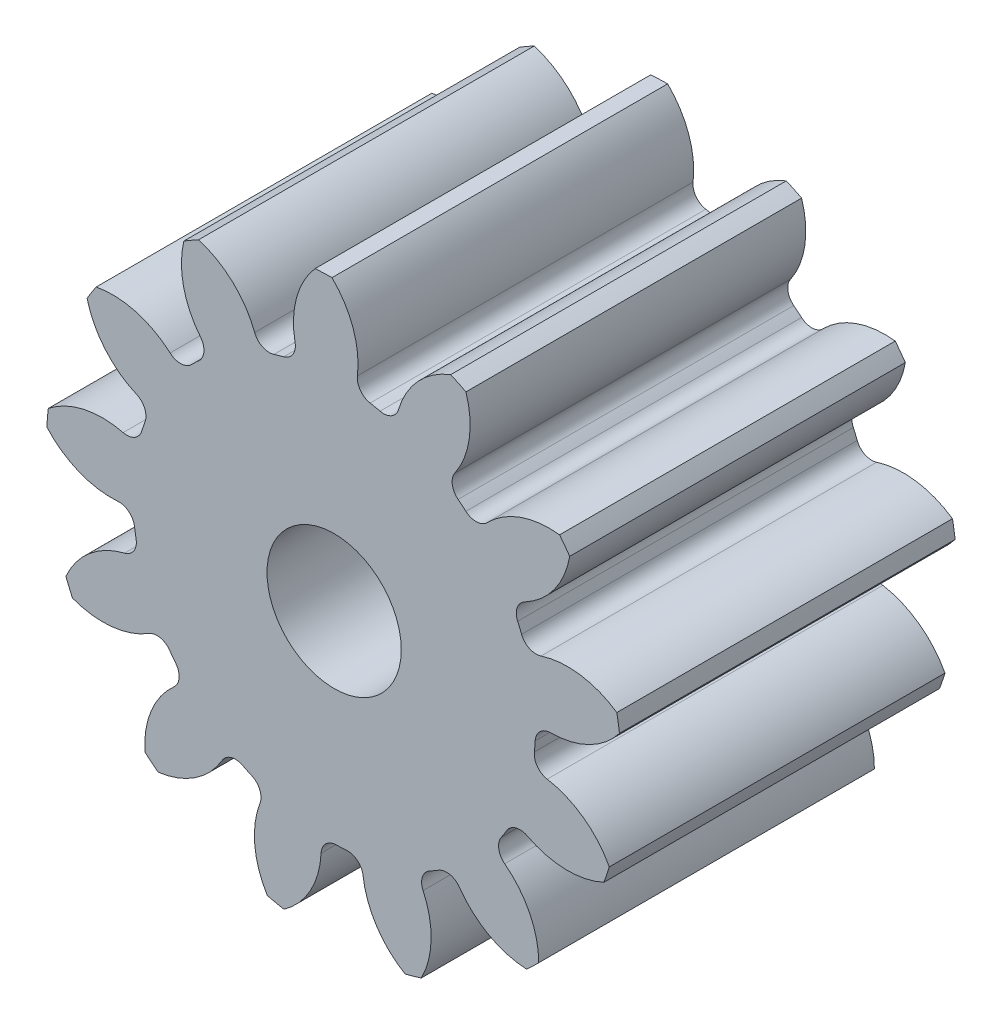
ISO-10303-21;
HEADER;
FILE_DESCRIPTION(('STEP AP214'),'2;1');
FILE_NAME('part.step','',(''),(''),'','','');
FILE_SCHEMA(('AUTOMOTIVE_DESIGN { 1 0 10303 214 1 1 1 1 }'));
ENDSEC;
DATA;
#1=APPLICATION_CONTEXT('core data for automotive mechanical design processes');
#2=APPLICATION_PROTOCOL_DEFINITION('international standard','automotive_design',2000,#1);
#3=PRODUCT_CONTEXT('',#1,'mechanical');
#4=PRODUCT('Part','Part','',(#3));
#5=PRODUCT_RELATED_PRODUCT_CATEGORY('part','',(#4));
#6=PRODUCT_DEFINITION_FORMATION('','',#4);
#7=PRODUCT_DEFINITION_CONTEXT('part definition',#1,'design');
#8=PRODUCT_DEFINITION('design','',#6,#7);
#9=PRODUCT_DEFINITION_SHAPE('','',#8);
#10=(LENGTH_UNIT() NAMED_UNIT(*) SI_UNIT(.MILLI.,.METRE.));
#11=(NAMED_UNIT(*) PLANE_ANGLE_UNIT() SI_UNIT($,.RADIAN.));
#12=(NAMED_UNIT(*) SI_UNIT($,.STERADIAN.) SOLID_ANGLE_UNIT());
#13=UNCERTAINTY_MEASURE_WITH_UNIT(LENGTH_MEASURE(1.E-05),#10,'distance_accuracy_value','');
#14=(GEOMETRIC_REPRESENTATION_CONTEXT(3) GLOBAL_UNCERTAINTY_ASSIGNED_CONTEXT((#13)) GLOBAL_UNIT_ASSIGNED_CONTEXT((#10,
#11,#12)) REPRESENTATION_CONTEXT('',''));
#15=CARTESIAN_POINT('',(0.,0.,0.));
#16=DIRECTION('',(0.,0.,1.));
#17=DIRECTION('',(1.,0.,0.));
#18=AXIS2_PLACEMENT_3D('',#15,#16,#17);
#19=CARTESIAN_POINT('',(0.,0.,88.9));
#20=DIRECTION('',(0.,0.,-1.));
#21=DIRECTION('',(-1.,0.,0.));
#22=AXIS2_PLACEMENT_3D('',#19,#20,#21);
#23=CYLINDRICAL_SURFACE('',#22,76.2);
#24=DIRECTION('',(0.,0.,-1.));
#25=VECTOR('',#24,1.);
#26=CARTESIAN_POINT('',(74.8705972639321,14.171579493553,44.45));
#27=LINE('',#26,#25);
#28=CARTESIAN_POINT('',(74.8705972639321,14.171579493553,88.9));
#29=VERTEX_POINT('',#28);
#30=CARTESIAN_POINT('',(74.8705972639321,14.171579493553,0.));
#31=VERTEX_POINT('',#30);
#32=EDGE_CURVE('E564',#29,#31,#27,.T.);
#33=ORIENTED_EDGE('',*,*,#32,.F.);
#34=CARTESIAN_POINT('',(0.,0.,88.9));
#35=DIRECTION('',(0.,0.,1.));
#36=DIRECTION('',(1.,0.,0.));
#37=AXIS2_PLACEMENT_3D('',#34,#35,#36);
#38=CIRCLE('',#37,76.2);
#39=CARTESIAN_POINT('',(75.5741301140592,9.74632533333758,88.9));
#40=VERTEX_POINT('',#39);
#41=EDGE_CURVE('E1019',#40,#29,#38,.T.);
#42=ORIENTED_EDGE('',*,*,#41,.F.);
#43=DIRECTION('',(0.,0.,-1.));
#44=VECTOR('',#43,1.);
#45=CARTESIAN_POINT('',(75.5741301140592,9.74632533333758,44.45));
#46=LINE('',#45,#44);
#47=CARTESIAN_POINT('',(75.5741301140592,9.74632533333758,0.));
#48=VERTEX_POINT('',#47);
#49=EDGE_CURVE('E1013',#48,#40,#46,.F.);
#50=ORIENTED_EDGE('',*,*,#49,.F.);
#51=CARTESIAN_POINT('',(0.,0.,0.));
#52=DIRECTION('',(0.,0.,1.));
#53=DIRECTION('',(1.,0.,0.));
#54=AXIS2_PLACEMENT_3D('',#51,#52,#53);
#55=CIRCLE('',#54,76.2);
#56=EDGE_CURVE('E1024',#48,#31,#55,.T.);
#57=ORIENTED_EDGE('',*,*,#56,.T.);
#58=EDGE_LOOP('',(#33,#42,#50,#57));
#59=FACE_BOUND('',#58,.T.);
#60=ADVANCED_FACE('F33',(#59),#23,.T.);
#61=DIRECTION('',(0.,0.,-1.));
#62=VECTOR('',#61,1.);
#63=CARTESIAN_POINT('',(62.3882256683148,43.7509919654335,44.45));
#64=LINE('',#63,#62);
#65=CARTESIAN_POINT('',(62.3882256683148,43.7509919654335,0.));
#66=VERTEX_POINT('',#65);
#67=CARTESIAN_POINT('',(62.3882256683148,43.7509919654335,88.9));
#68=VERTEX_POINT('',#67);
#69=EDGE_CURVE('E535',#66,#68,#64,.F.);
#70=ORIENTED_EDGE('',*,*,#69,.F.);
#71=CARTESIAN_POINT('',(59.708760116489,47.342411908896,0.));
#72=VERTEX_POINT('',#71);
#73=EDGE_CURVE('E1027',#66,#72,#55,.T.);
#74=ORIENTED_EDGE('',*,*,#73,.T.);
#75=DIRECTION('',(0.,0.,-1.));
#76=VECTOR('',#75,1.);
#77=CARTESIAN_POINT('',(59.708760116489,47.342411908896,44.45));
#78=LINE('',#77,#76);
#79=CARTESIAN_POINT('',(59.708760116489,47.342411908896,88.9));
#80=VERTEX_POINT('',#79);
#81=EDGE_CURVE('E597',#80,#72,#78,.T.);
#82=ORIENTED_EDGE('',*,*,#81,.F.);
#83=EDGE_CURVE('E1022',#68,#80,#38,.T.);
#84=ORIENTED_EDGE('',*,*,#83,.F.);
#85=EDGE_LOOP('',(#70,#74,#82,#84));
#86=FACE_BOUND('',#85,.T.);
#87=ADVANCED_FACE('F1176',(#86),#23,.T.);
#88=CARTESIAN_POINT('',(0.,0.,88.9));
#89=DIRECTION('',(0.,0.,1.));
#90=DIRECTION('',(1.,0.,0.));
#91=AXIS2_PLACEMENT_3D('',#88,#89,#90);
#92=PLANE('',#91);
#93=CARTESIAN_POINT('',(0.,0.,88.9000000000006));
#94=DIRECTION('',(0.,0.,1.));
#95=DIRECTION('',(1.,0.,0.));
#96=AXIS2_PLACEMENT_3D('',#93,#94,#95);
#97=CIRCLE('',#96,17.78);
#98=CARTESIAN_POINT('',(17.78,0.,88.9000000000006));
#99=VERTEX_POINT('',#98);
#100=EDGE_CURVE('E552',#99,#99,#97,.T.);
#101=ORIENTED_EDGE('',*,*,#100,.F.);
#102=EDGE_LOOP('',(#101));
#103=FACE_BOUND('',#102,.T.);
#104=ORIENTED_EDGE('',*,*,#41,.T.);
#105=CARTESIAN_POINT('',(61.8716266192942,-4.79691429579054,88.9));
#106=DIRECTION('',(0.,0.,-1.));
#107=DIRECTION('',(0.885456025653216,0.464723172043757,0.));
#108=AXIS2_PLACEMENT_3D('',#105,#106,#107);
#109=CIRCLE('',#108,22.9951515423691);
#110=CARTESIAN_POINT('',(54.7741754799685,17.0755154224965,88.9));
#111=VERTEX_POINT('',#110);
#112=EDGE_CURVE('E544',#111,#29,#109,.T.);
#113=ORIENTED_EDGE('',*,*,#112,.F.);
#114=CARTESIAN_POINT('',(53.4978711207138,21.0087411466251,88.9));
#115=DIRECTION('',(0.,0.,1.));
#116=DIRECTION('',(-0.885456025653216,-0.464723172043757,0.));
#117=AXIS2_PLACEMENT_3D('',#114,#115,#116);
#118=CIRCLE('',#117,4.13511999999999);
#119=CARTESIAN_POINT('',(49.6488993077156,19.4972407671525,88.9));
#120=VERTEX_POINT('',#119);
#121=EDGE_CURVE('E542',#120,#111,#118,.T.);
#122=ORIENTED_EDGE('',*,*,#121,.F.);
#123=CARTESIAN_POINT('',(0.,0.,88.9));
#124=DIRECTION('',(0.,0.,-1.));
#125=DIRECTION('',(0.885456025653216,0.464723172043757,0.));
#126=AXIS2_PLACEMENT_3D('',#123,#124,#125);
#127=CIRCLE('',#126,53.34);
#128=CARTESIAN_POINT('',(48.6069792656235,21.9662733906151,88.9));
#129=VERTEX_POINT('',#128);
#130=EDGE_CURVE('E527',#129,#120,#127,.T.);
#131=ORIENTED_EDGE('',*,*,#130,.F.);
#132=CARTESIAN_POINT('',(52.3751774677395,23.6691825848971,88.9));
#133=DIRECTION('',(0.,0.,1.));
#134=DIRECTION('',(-0.885456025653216,-0.464723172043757,0.));
#135=AXIS2_PLACEMENT_3D('',#132,#133,#134);
#136=CIRCLE('',#135,4.13511999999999);
#137=CARTESIAN_POINT('',(50.4478167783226,27.3276656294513,88.9));
#138=VERTEX_POINT('',#137);
#139=EDGE_CURVE('E519',#138,#129,#136,.T.);
#140=ORIENTED_EDGE('',*,*,#139,.F.);
#141=CARTESIAN_POINT('',(39.7298808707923,47.6722679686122,88.9));
#142=DIRECTION('',(0.,0.,-1.));
#143=DIRECTION('',(-0.885456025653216,-0.464723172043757,0.));
#144=AXIS2_PLACEMENT_3D('',#141,#142,#143);
#145=CIRCLE('',#144,22.9951515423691);
#146=EDGE_CURVE('E549',#68,#138,#145,.T.);
#147=ORIENTED_EDGE('',*,*,#146,.F.);
#148=ORIENTED_EDGE('',*,*,#83,.T.);
#149=CARTESIAN_POINT('',(57.0138418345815,24.5057219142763,88.9));
#150=DIRECTION('',(0.,0.,-1.));
#151=DIRECTION('',(0.568064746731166,0.822983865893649,0.));
#152=AXIS2_PLACEMENT_3D('',#149,#150,#151);
#153=CIRCLE('',#152,22.9951515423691);
#154=CARTESIAN_POINT('',(40.5647360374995,40.5744465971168,88.9));
#155=VERTEX_POINT('',#154);
#156=EDGE_CURVE('E573',#155,#80,#153,.T.);
#157=ORIENTED_EDGE('',*,*,#156,.F.);
#158=CARTESIAN_POINT('',(37.6067635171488,43.4640168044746,88.9));
#159=DIRECTION('',(0.,0.,1.));
#160=DIRECTION('',(-0.568064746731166,-0.822983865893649,0.));
#161=AXIS2_PLACEMENT_3D('',#158,#159,#160);
#162=CIRCLE('',#161,4.13511999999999);
#163=CARTESIAN_POINT('',(34.9010974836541,40.3369432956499,88.9));
#164=VERTEX_POINT('',#163);
#165=EDGE_CURVE('E571',#164,#155,#162,.T.);
#166=ORIENTED_EDGE('',*,*,#165,.F.);
#167=CARTESIAN_POINT('',(0.,0.,88.9));
#168=DIRECTION('',(0.,0.,-1.));
#169=DIRECTION('',(0.568064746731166,0.822983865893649,0.));
#170=AXIS2_PLACEMENT_3D('',#167,#168,#169);
#171=CIRCLE('',#170,53.34);
#172=CARTESIAN_POINT('',(32.8311064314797,42.0389587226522,88.9));
#173=VERTEX_POINT('',#172);
#174=EDGE_CURVE('E568',#173,#164,#171,.T.);
#175=ORIENTED_EDGE('',*,*,#174,.F.);
#176=CARTESIAN_POINT('',(35.3762988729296,45.2979789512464,88.9));
#177=DIRECTION('',(0.,0.,1.));
#178=DIRECTION('',(-0.568064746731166,-0.822983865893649,0.));
#179=AXIS2_PLACEMENT_3D('',#176,#177,#178);
#180=CIRCLE('',#179,4.13511999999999);
#181=CARTESIAN_POINT('',(31.9695238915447,47.6417156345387,88.9));
#182=VERTEX_POINT('',#181);
#183=EDGE_CURVE('E566',#182,#173,#180,.T.);
#184=ORIENTED_EDGE('',*,*,#183,.F.);
#185=CARTESIAN_POINT('',(13.0246548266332,60.6750931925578,88.9));
#186=DIRECTION('',(0.,0.,-1.));
#187=DIRECTION('',(-0.568064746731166,-0.822983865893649,0.));
#188=AXIS2_PLACEMENT_3D('',#185,#186,#187);
#189=CIRCLE('',#188,22.9951515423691);
#190=CARTESIAN_POINT('',(34.9099305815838,67.7328335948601,88.9));
#191=VERTEX_POINT('',#190);
#192=EDGE_CURVE('E576',#191,#182,#189,.T.);
#193=ORIENTED_EDGE('',*,*,#192,.F.);
#194=CARTESIAN_POINT('',(30.8683655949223,69.6676682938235,88.9));
#195=VERTEX_POINT('',#194);
#196=EDGE_CURVE('E1061',#191,#195,#38,.T.);
#197=ORIENTED_EDGE('',*,*,#196,.T.);
#198=CARTESIAN_POINT('',(39.0948729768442,48.1943925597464,88.9));
#199=DIRECTION('',(0.,0.,-1.));
#200=DIRECTION('',(0.120536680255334,0.992708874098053,0.));
#201=AXIS2_PLACEMENT_3D('',#198,#199,#200);
#202=CIRCLE('',#201,22.9951515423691);
#203=CARTESIAN_POINT('',(17.0624044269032,54.7782610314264,88.9));
#204=VERTEX_POINT('',#203);
#205=EDGE_CURVE('E608',#204,#195,#202,.T.);
#206=ORIENTED_EDGE('',*,*,#205,.F.);
#207=CARTESIAN_POINT('',(13.1003996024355,55.9622100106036,88.9));
#208=DIRECTION('',(0.,0.,1.));
#209=DIRECTION('',(-0.120536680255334,-0.992708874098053,0.));
#210=AXIS2_PLACEMENT_3D('',#207,#208,#209);
#211=CIRCLE('',#210,4.13511999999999);
#212=CARTESIAN_POINT('',(12.1578748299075,51.9359382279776,88.9));
#213=VERTEX_POINT('',#212);
#214=EDGE_CURVE('E606',#213,#204,#211,.T.);
#215=ORIENTED_EDGE('',*,*,#214,.F.);
#216=CARTESIAN_POINT('',(0.,0.,88.9));
#217=DIRECTION('',(0.,0.,-1.));
#218=DIRECTION('',(0.120536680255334,0.992708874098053,0.));
#219=AXIS2_PLACEMENT_3D('',#216,#217,#218);
#220=CIRCLE('',#219,53.34);
#221=CARTESIAN_POINT('',(9.53402277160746,52.4810252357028,88.9));
#222=VERTEX_POINT('',#221);
#223=EDGE_CURVE('E603',#222,#213,#220,.T.);
#224=ORIENTED_EDGE('',*,*,#223,.F.);
#225=CARTESIAN_POINT('',(10.2731365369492,56.5495542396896,88.9));
#226=DIRECTION('',(0.,0.,1.));
#227=DIRECTION('',(-0.120536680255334,-0.992708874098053,0.));
#228=AXIS2_PLACEMENT_3D('',#225,#226,#227);
#229=CIRCLE('',#228,4.13511999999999);
#230=CARTESIAN_POINT('',(6.16739835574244,57.0416227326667,88.9));
#231=VERTEX_POINT('',#230);
#232=EDGE_CURVE('E601',#231,#222,#229,.T.);
#233=ORIENTED_EDGE('',*,*,#232,.F.);
#234=CARTESIAN_POINT('',(-16.6643626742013,59.7779857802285,88.9));
#235=DIRECTION('',(0.,0.,-1.));
#236=DIRECTION('',(-0.120536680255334,-0.992708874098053,0.));
#237=AXIS2_PLACEMENT_3D('',#234,#235,#236);
#238=CIRCLE('',#237,22.9951515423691);
#239=CARTESIAN_POINT('',(-0.565808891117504,76.1978993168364,88.9));
#240=VERTEX_POINT('',#239);
#241=EDGE_CURVE('E611',#240,#231,#238,.T.);
#242=ORIENTED_EDGE('',*,*,#241,.F.);
#243=CARTESIAN_POINT('',(-5.04359948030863,76.0329014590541,88.9));
#244=VERTEX_POINT('',#243);
#245=EDGE_CURVE('E1158',#240,#244,#38,.T.);
#246=ORIENTED_EDGE('',*,*,#245,.T.);
#247=CARTESIAN_POINT('',(12.2197398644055,60.8423086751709,88.9));
#248=DIRECTION('',(0.,0.,-1.));
#249=DIRECTION('',(-0.354604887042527,0.935016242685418,0.));
#250=AXIS2_PLACEMENT_3D('',#247,#248,#249);
#251=CIRCLE('',#250,22.9951515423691);
#252=CARTESIAN_POINT('',(-10.3487184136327,56.433036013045,88.9));
#253=VERTEX_POINT('',#252);
#254=EDGE_CURVE('E646',#253,#244,#251,.T.);
#255=ORIENTED_EDGE('',*,*,#254,.F.);
#256=CARTESIAN_POINT('',(-14.4071079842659,55.6401353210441,88.9));
#257=DIRECTION('',(0.,0.,1.));
#258=DIRECTION('',(0.354604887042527,-0.935016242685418,0.));
#259=AXIS2_PLACEMENT_3D('',#256,#257,#258);
#260=CIRCLE('',#259,4.13511999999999);
#261=CARTESIAN_POINT('',(-13.370570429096,51.6370356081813,88.9));
#262=VERTEX_POINT('',#261);
#263=EDGE_CURVE('E644',#262,#253,#260,.T.);
#264=ORIENTED_EDGE('',*,*,#263,.F.);
#265=CARTESIAN_POINT('',(0.,0.,88.9));
#266=DIRECTION('',(0.,0.,-1.));
#267=DIRECTION('',(-0.354604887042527,0.935016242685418,0.));
#268=AXIS2_PLACEMENT_3D('',#265,#266,#267);
#269=CIRCLE('',#268,53.34);
#270=CARTESIAN_POINT('',(-15.9471906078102,50.9003213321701,88.9));
#271=VERTEX_POINT('',#270);
#272=EDGE_CURVE('E641',#271,#262,#269,.T.);
#273=ORIENTED_EDGE('',*,*,#272,.F.);
#274=CARTESIAN_POINT('',(-17.1834775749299,54.846308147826,88.9));
#275=DIRECTION('',(0.,0.,1.));
#276=DIRECTION('',(0.354604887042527,-0.935016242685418,0.));
#277=AXIS2_PLACEMENT_3D('',#274,#275,#276);
#278=CIRCLE('',#277,4.13511999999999);
#279=CARTESIAN_POINT('',(-21.047603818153,53.373981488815,88.9));
#280=VERTEX_POINT('',#279);
#281=EDGE_CURVE('E639',#280,#271,#278,.T.);
#282=ORIENTED_EDGE('',*,*,#281,.F.);
#283=CARTESIAN_POINT('',(-42.5357755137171,45.1864622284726,88.9));
#284=DIRECTION('',(0.,0.,-1.));
#285=DIRECTION('',(0.354604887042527,-0.935016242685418,0.));
#286=AXIS2_PLACEMENT_3D('',#283,#284,#285);
#287=CIRCLE('',#286,22.9951515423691);
#288=CARTESIAN_POINT('',(-35.9119283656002,67.2069445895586,88.9));
#289=VERTEX_POINT('',#288);
#290=EDGE_CURVE('E649',#289,#280,#287,.T.);
#291=ORIENTED_EDGE('',*,*,#290,.F.);
#292=CARTESIAN_POINT('',(-39.8001366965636,64.9799131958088,88.9));
#293=VERTEX_POINT('',#292);
#294=EDGE_CURVE('E1154',#289,#293,#38,.T.);
#295=ORIENTED_EDGE('',*,*,#294,.T.);
#296=CARTESIAN_POINT('',(-17.454788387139,59.5519851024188,88.9));
#297=DIRECTION('',(0.,0.,-1.));
#298=DIRECTION('',(-0.748510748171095,0.663122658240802,0.));
#299=AXIS2_PLACEMENT_3D('',#296,#297,#298);
#300=CIRCLE('',#299,22.9951515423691);
#301=CARTESIAN_POINT('',(-35.3890745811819,45.1596825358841,88.9));
#302=VERTEX_POINT('',#301);
#303=EDGE_CURVE('E684',#302,#293,#300,.T.);
#304=ORIENTED_EDGE('',*,*,#303,.F.);
#305=CARTESIAN_POINT('',(-38.6141207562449,42.5715761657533,88.9));
#306=DIRECTION('',(0.,0.,1.));
#307=DIRECTION('',(0.748510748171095,-0.663122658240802,0.));
#308=AXIS2_PLACEMENT_3D('',#305,#306,#307);
#309=CIRCLE('',#308,4.13511999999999);
#310=CARTESIAN_POINT('',(-35.8359791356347,39.5087104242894,88.9));
#311=VERTEX_POINT('',#310);
#312=EDGE_CURVE('E682',#311,#302,#309,.T.);
#313=ORIENTED_EDGE('',*,*,#312,.F.);
#314=CARTESIAN_POINT('',(0.,0.,88.9));
#315=DIRECTION('',(0.,0.,-1.));
#316=DIRECTION('',(-0.748510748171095,0.663122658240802,0.));
#317=AXIS2_PLACEMENT_3D('',#314,#315,#316);
#318=CIRCLE('',#317,53.34);
#319=CARTESIAN_POINT('',(-37.775094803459,37.6589672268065,88.9));
#320=VERTEX_POINT('',#319);
#321=EDGE_CURVE('E679',#320,#311,#318,.T.);
#322=ORIENTED_EDGE('',*,*,#321,.F.);
#323=CARTESIAN_POINT('',(-40.7035640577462,40.5784338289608,88.9));
#324=DIRECTION('',(0.,0.,1.));
#325=DIRECTION('',(0.748510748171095,-0.663122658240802,0.));
#326=AXIS2_PLACEMENT_3D('',#323,#324,#325);
#327=CIRCLE('',#326,4.13511999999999);
#328=CARTESIAN_POINT('',(-43.4408536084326,37.4790043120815,88.9));
#329=VERTEX_POINT('',#328);
#330=EDGE_CURVE('E677',#329,#320,#327,.T.);
#331=ORIENTED_EDGE('',*,*,#330,.F.);
#332=CARTESIAN_POINT('',(-58.6627547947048,20.2432647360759,88.9));
#333=DIRECTION('',(0.,0.,-1.));
#334=DIRECTION('',(0.748510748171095,-0.663122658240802,0.));
#335=AXIS2_PLACEMENT_3D('',#332,#333,#334);
#336=CIRCLE('',#335,22.9951515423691);
#337=CARTESIAN_POINT('',(-63.0310578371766,42.8196887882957,88.9));
#338=VERTEX_POINT('',#337);
#339=EDGE_CURVE('E687',#338,#329,#336,.T.);
#340=ORIENTED_EDGE('',*,*,#339,.F.);
#341=CARTESIAN_POINT('',(-65.4389422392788,39.0408099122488,88.9));
#342=VERTEX_POINT('',#341);
#343=EDGE_CURVE('E1150',#338,#342,#38,.T.);
#344=ORIENTED_EDGE('',*,*,#343,.T.);
#345=CARTESIAN_POINT('',(-43.1306349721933,44.6190194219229,88.9));
#346=DIRECTION('',(0.,0.,-1.));
#347=DIRECTION('',(-0.97094181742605,0.239315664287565,0.));
#348=AXIS2_PLACEMENT_3D('',#345,#346,#347);
#349=CIRCLE('',#348,22.9951515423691);
#350=CARTESIAN_POINT('',(-52.3222202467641,23.5407900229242,88.9));
#351=VERTEX_POINT('',#350);
#352=EDGE_CURVE('E722',#351,#342,#349,.T.);
#353=ORIENTED_EDGE('',*,*,#352,.F.);
#354=CARTESIAN_POINT('',(-53.9751038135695,19.7503819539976,88.9));
#355=DIRECTION('',(0.,0.,1.));
#356=DIRECTION('',(0.97094181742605,-0.239315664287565,0.));
#357=AXIS2_PLACEMENT_3D('',#354,#355,#356);
#358=CIRCLE('',#357,4.13511999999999);
#359=CARTESIAN_POINT('',(-50.091796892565,18.3294158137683,88.9));
#360=VERTEX_POINT('',#359);
#361=EDGE_CURVE('E720',#360,#351,#358,.T.);
#362=ORIENTED_EDGE('',*,*,#361,.F.);
#363=CARTESIAN_POINT('',(0.,0.,88.9));
#364=DIRECTION('',(0.,0.,-1.));
#365=DIRECTION('',(-0.97094181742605,0.239315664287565,0.));
#366=AXIS2_PLACEMENT_3D('',#363,#364,#365);
#367=CIRCLE('',#366,53.34);
#368=CARTESIAN_POINT('',(-50.9491800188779,15.7903975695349,88.9));
#369=VERTEX_POINT('',#368);
#370=EDGE_CURVE('E717',#369,#360,#367,.T.);
#371=ORIENTED_EDGE('',*,*,#370,.F.);
#372=CARTESIAN_POINT('',(-54.8989545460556,17.0145293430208,88.9));
#373=DIRECTION('',(0.,0.,1.));
#374=DIRECTION('',(0.97094181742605,-0.239315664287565,0.));
#375=AXIS2_PLACEMENT_3D('',#372,#373,#374);
#376=CIRCLE('',#375,4.13511999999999);
#377=CARTESIAN_POINT('',(-55.8823273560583,12.9980389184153,88.9));
#378=VERTEX_POINT('',#377);
#379=EDGE_CURVE('E715',#378,#369,#376,.T.);
#380=ORIENTED_EDGE('',*,*,#379,.F.);
#381=CARTESIAN_POINT('',(-61.350803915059,-9.33742074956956,88.9));
#382=DIRECTION('',(0.,0.,-1.));
#383=DIRECTION('',(0.97094181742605,-0.239315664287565,0.));
#384=AXIS2_PLACEMENT_3D('',#381,#382,#383);
#385=CIRCLE('',#384,22.9951515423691);
#386=CARTESIAN_POINT('',(-75.7105315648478,8.62295831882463,88.9));
#387=VERTEX_POINT('',#386);
#388=EDGE_CURVE('E725',#387,#378,#385,.T.);
#389=ORIENTED_EDGE('',*,*,#388,.F.);
#390=CARTESIAN_POINT('',(-76.0864747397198,4.15792757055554,88.9));
#391=VERTEX_POINT('',#390);
#392=EDGE_CURVE('E1146',#387,#391,#38,.T.);
#393=ORIENTED_EDGE('',*,*,#392,.T.);
#394=CARTESIAN_POINT('',(-58.9257728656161,19.4643741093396,88.9));
#395=DIRECTION('',(0.,0.,-1.));
#396=DIRECTION('',(-0.970941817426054,-0.239315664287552,0.));
#397=AXIS2_PLACEMENT_3D('',#394,#395,#396);
#398=CIRCLE('',#397,22.9951515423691);
#399=CARTESIAN_POINT('',(-57.2689758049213,-3.47101378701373,88.9));
#400=VERTEX_POINT('',#399);
#401=EDGE_CURVE('E760',#400,#391,#398,.T.);
#402=ORIENTED_EDGE('',*,*,#401,.F.);
#403=CARTESIAN_POINT('',(-56.9710410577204,-7.59538674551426,88.9));
#404=DIRECTION('',(0.,0.,1.));
#405=DIRECTION('',(0.970941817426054,0.239315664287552,0.));
#406=AXIS2_PLACEMENT_3D('',#403,#404,#405);
#407=CIRCLE('',#406,4.13511999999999);
#408=CARTESIAN_POINT('',(-52.872187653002,-7.04892706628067,88.9));
#409=VERTEX_POINT('',#408);
#410=EDGE_CURVE('E758',#409,#400,#407,.T.);
#411=ORIENTED_EDGE('',*,*,#410,.F.);
#412=CARTESIAN_POINT('',(0.,0.,88.9));
#413=DIRECTION('',(0.,0.,-1.));
#414=DIRECTION('',(-0.970941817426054,-0.239315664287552,0.));
#415=AXIS2_PLACEMENT_3D('',#412,#413,#414);
#416=CIRCLE('',#415,53.34);
#417=CARTESIAN_POINT('',(-52.451422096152,-9.69556187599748,88.9));
#418=VERTEX_POINT('',#417);
#419=EDGE_CURVE('E755',#418,#409,#416,.T.);
#420=ORIENTED_EDGE('',*,*,#419,.F.);
#421=CARTESIAN_POINT('',(-56.517656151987,-10.4471987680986,88.9));
#422=DIRECTION('',(0.,0.,1.));
#423=DIRECTION('',(0.970941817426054,0.239315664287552,0.));
#424=AXIS2_PLACEMENT_3D('',#421,#422,#423);
#425=CIRCLE('',#424,4.13511999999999);
#426=CARTESIAN_POINT('',(-55.5218333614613,-14.46062054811,88.9));
#427=VERTEX_POINT('',#426);
#428=EDGE_CURVE('E753',#427,#418,#425,.T.);
#429=ORIENTED_EDGE('',*,*,#428,.F.);
#430=CARTESIAN_POINT('',(-49.9841232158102,-36.7790156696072,88.9));
#431=DIRECTION('',(0.,0.,-1.));
#432=DIRECTION('',(0.970941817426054,0.239315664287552,0.));
#433=AXIS2_PLACEMENT_3D('',#430,#431,#432);
#434=CIRCLE('',#433,22.9951515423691);
#435=CARTESIAN_POINT('',(-71.0456349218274,-27.5491879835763,88.9));
#436=VERTEX_POINT('',#435);
#437=EDGE_CURVE('E763',#436,#427,#434,.T.);
#438=ORIENTED_EDGE('',*,*,#437,.F.);
#439=CARTESIAN_POINT('',(-69.3035128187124,-31.6774858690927,88.9));
#440=VERTEX_POINT('',#439);
#441=EDGE_CURVE('E1142',#436,#440,#38,.T.);
#442=ORIENTED_EDGE('',*,*,#441,.T.);
#443=CARTESIAN_POINT('',(-61.2217263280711,-10.1493247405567,88.9));
#444=DIRECTION('',(0.,0.,-1.));
#445=DIRECTION('',(-0.748510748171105,-0.663122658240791,0.));
#446=AXIS2_PLACEMENT_3D('',#443,#444,#445);
#447=CIRCLE('',#446,22.9951515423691);
#448=CARTESIAN_POINT('',(-49.0960991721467,-29.6876501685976,88.9));
#449=VERTEX_POINT('',#448);
#450=EDGE_CURVE('E798',#449,#440,#447,.T.);
#451=ORIENTED_EDGE('',*,*,#450,.F.);
#452=CARTESIAN_POINT('',(-46.9155993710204,-33.2011438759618,88.9));
#453=DIRECTION('',(0.,0.,1.));
#454=DIRECTION('',(0.748510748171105,0.663122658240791,0.));
#455=AXIS2_PLACEMENT_3D('',#452,#453,#454);
#456=CIRCLE('',#455,4.13511999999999);
#457=CARTESIAN_POINT('',(-43.5401974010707,-30.8124457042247,88.9));
#458=VERTEX_POINT('',#457);
#459=EDGE_CURVE('E796',#458,#449,#456,.T.);
#460=ORIENTED_EDGE('',*,*,#459,.F.);
#461=CARTESIAN_POINT('',(0.,0.,88.9));
#462=DIRECTION('',(0.,0.,-1.));
#463=DIRECTION('',(-0.748510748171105,-0.663122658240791,0.));
#464=AXIS2_PLACEMENT_3D('',#461,#462,#463);
#465=CIRCLE('',#464,53.34);
#466=CARTESIAN_POINT('',(-41.9376754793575,-32.9603849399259,88.9));
#467=VERTEX_POINT('',#466);
#468=EDGE_CURVE('E793',#467,#458,#465,.T.);
#469=ORIENTED_EDGE('',*,*,#468,.F.);
#470=CARTESIAN_POINT('',(-45.1888438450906,-35.5155995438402,88.9));
#471=DIRECTION('',(0.,0.,1.));
#472=DIRECTION('',(0.748510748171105,0.663122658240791,0.));
#473=AXIS2_PLACEMENT_3D('',#470,#471,#472);
#474=CIRCLE('',#473,4.13511999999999);
#475=CARTESIAN_POINT('',(-42.4419564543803,-38.6065261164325,88.9));
#476=VERTEX_POINT('',#475);
#477=EDGE_CURVE('E791',#476,#467,#474,.T.);
#478=ORIENTED_EDGE('',*,*,#477,.F.);
#479=CARTESIAN_POINT('',(-27.1666822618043,-55.7949813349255,88.9));
#480=DIRECTION('',(0.,0.,-1.));
#481=DIRECTION('',(0.748510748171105,0.663122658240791,0.));
#482=AXIS2_PLACEMENT_3D('',#479,#480,#481);
#483=CIRCLE('',#482,22.9951515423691);
#484=CARTESIAN_POINT('',(-50.1050395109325,-57.4101473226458,88.9));
#485=VERTEX_POINT('',#484);
#486=EDGE_CURVE('E801',#485,#476,#483,.T.);
#487=ORIENTED_EDGE('',*,*,#486,.F.);
#488=CARTESIAN_POINT('',(-46.6439513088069,-60.2559690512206,88.9));
#489=VERTEX_POINT('',#488);
#490=EDGE_CURVE('E1138',#485,#489,#38,.T.);
#491=ORIENTED_EDGE('',*,*,#490,.T.);
#492=CARTESIAN_POINT('',(-49.4925200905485,-37.4379356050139,88.9));
#493=DIRECTION('',(0.,0.,-1.));
#494=DIRECTION('',(-0.35460488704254,-0.935016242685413,0.));
#495=AXIS2_PLACEMENT_3D('',#492,#493,#494);
#496=CIRCLE('',#495,22.9951515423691);
#497=CARTESIAN_POINT('',(-29.6758978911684,-49.1032036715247,88.9));
#498=VERTEX_POINT('',#497);
#499=EDGE_CURVE('E836',#498,#489,#496,.T.);
#500=ORIENTED_EDGE('',*,*,#499,.F.);
#501=CARTESIAN_POINT('',(-26.1123592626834,-51.2009190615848,88.9));
#502=DIRECTION('',(0.,0.,1.));
#503=DIRECTION('',(0.35460488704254,0.935016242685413,0.));
#504=AXIS2_PLACEMENT_3D('',#501,#502,#503);
#505=CIRCLE('',#504,4.13511999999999);
#506=CARTESIAN_POINT('',(-24.2336726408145,-47.5172043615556,88.9));
#507=VERTEX_POINT('',#506);
#508=EDGE_CURVE('E834',#507,#498,#505,.T.);
#509=ORIENTED_EDGE('',*,*,#508,.F.);
#510=CARTESIAN_POINT('',(0.,0.,88.9));
#511=DIRECTION('',(0.,0.,-1.));
#512=DIRECTION('',(-0.35460488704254,-0.935016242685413,0.));
#513=AXIS2_PLACEMENT_3D('',#510,#511,#512);
#514=CIRCLE('',#513,53.34);
#515=CARTESIAN_POINT('',(-21.8165128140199,-48.6743810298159,88.9));
#516=VERTEX_POINT('',#515);
#517=EDGE_CURVE('E831',#516,#507,#514,.T.);
#518=ORIENTED_EDGE('',*,*,#517,.F.);
#519=CARTESIAN_POINT('',(-23.5078119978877,-52.4478044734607,88.9));
#520=DIRECTION('',(0.,0.,1.));
#521=DIRECTION('',(0.35460488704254,0.935016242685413,0.));
#522=AXIS2_PLACEMENT_3D('',#519,#520,#521);
#523=CIRCLE('',#522,4.13511999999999);
#524=CARTESIAN_POINT('',(-19.639138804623,-53.9081418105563,88.9));
#525=VERTEX_POINT('',#524);
#526=EDGE_CURVE('E829',#525,#516,#523,.T.);
#527=ORIENTED_EDGE('',*,*,#526,.F.);
#528=CARTESIAN_POINT('',(1.87431820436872,-62.028989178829,88.9));
#529=DIRECTION('',(0.,0.,-1.));
#530=DIRECTION('',(0.35460488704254,0.935016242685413,0.));
#531=AXIS2_PLACEMENT_3D('',#528,#529,#530);
#532=CIRCLE('',#531,22.9951515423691);
#533=CARTESIAN_POINT('',(-17.6859833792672,-74.1191337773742,88.9));
#534=VERTEX_POINT('',#533);
#535=EDGE_CURVE('E839',#534,#525,#532,.T.);
#536=ORIENTED_EDGE('',*,*,#535,.F.);
#537=CARTESIAN_POINT('',(-13.2988226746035,-75.0305358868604,88.9));
#538=VERTEX_POINT('',#537);
#539=EDGE_CURVE('E1134',#534,#538,#38,.T.);
#540=ORIENTED_EDGE('',*,*,#539,.T.);
#541=CARTESIAN_POINT('',(-26.4251739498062,-56.1499665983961,88.9));
#542=DIRECTION('',(0.,0.,-1.));
#543=DIRECTION('',(0.12053668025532,-0.992708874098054,0.));
#544=AXIS2_PLACEMENT_3D('',#541,#542,#543);
#545=CIRCLE('',#544,22.9951515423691);
#546=CARTESIAN_POINT('',(-3.45730603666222,-57.2698049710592,88.9));
#547=VERTEX_POINT('',#546);
#548=EDGE_CURVE('E874',#547,#538,#545,.T.);
#549=ORIENTED_EDGE('',*,*,#548,.F.);
#550=CARTESIAN_POINT('',(0.672907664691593,-57.4711807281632,88.9));
#551=DIRECTION('',(0.,0.,1.));
#552=DIRECTION('',(-0.12053668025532,0.992708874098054,0.));
#553=AXIS2_PLACEMENT_3D('',#550,#551,#552);
#554=CIRCLE('',#553,4.13511999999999);
#555=CARTESIAN_POINT('',(0.624494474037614,-53.336344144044,88.9));
#556=VERTEX_POINT('',#555);
#557=EDGE_CURVE('E872',#556,#547,#554,.T.);
#558=ORIENTED_EDGE('',*,*,#557,.F.);
#559=CARTESIAN_POINT('',(0.,0.,88.9));
#560=DIRECTION('',(0.,0.,-1.));
#561=DIRECTION('',(0.12053668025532,-0.992708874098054,0.));
#562=AXIS2_PLACEMENT_3D('',#559,#560,#561);
#563=CIRCLE('',#562,53.34);
#564=CARTESIAN_POINT('',(3.30255001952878,-53.2376630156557,88.9));
#565=VERTEX_POINT('',#564);
#566=EDGE_CURVE('E869',#565,#556,#563,.T.);
#567=ORIENTED_EDGE('',*,*,#566,.F.);
#568=CARTESIAN_POINT('',(3.55857627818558,-57.3648494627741,88.9));
#569=DIRECTION('',(0.,0.,1.));
#570=DIRECTION('',(-0.12053668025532,0.992708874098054,0.));
#571=AXIS2_PLACEMENT_3D('',#568,#569,#570);
#572=CIRCLE('',#571,4.13511999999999);
#573=CARTESIAN_POINT('',(7.66276886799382,-56.8600518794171,88.9));
#574=VERTEX_POINT('',#573);
#575=EDGE_CURVE('E867',#574,#565,#572,.T.);
#576=ORIENTED_EDGE('',*,*,#575,.F.);
#577=CARTESIAN_POINT('',(30.4859349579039,-54.0529031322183,88.9));
#578=DIRECTION('',(0.,0.,-1.));
#579=DIRECTION('',(-0.12053668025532,0.992708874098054,0.));
#580=AXIS2_PLACEMENT_3D('',#577,#578,#579);
#581=CIRCLE('',#580,22.9951515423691);
#582=CARTESIAN_POINT('',(18.7847184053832,-73.8483199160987,88.9));
#583=VERTEX_POINT('',#582);
#584=EDGE_CURVE('E877',#583,#574,#581,.T.);
#585=ORIENTED_EDGE('',*,*,#584,.F.);
#586=CARTESIAN_POINT('',(23.0929059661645,-72.6165111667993,88.9));
#587=VERTEX_POINT('',#586);
#588=EDGE_CURVE('E1130',#583,#587,#38,.T.);
#589=ORIENTED_EDGE('',*,*,#588,.T.);
#590=CARTESIAN_POINT('',(2.69586108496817,-61.9987169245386,88.9));
#591=DIRECTION('',(0.,0.,-1.));
#592=DIRECTION('',(0.568064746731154,-0.822983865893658,0.));
#593=AXIS2_PLACEMENT_3D('',#590,#591,#592);
#594=CIRCLE('',#593,22.9951515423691);
#595=CARTESIAN_POINT('',(23.5533129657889,-52.3165841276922,88.9));
#596=VERTEX_POINT('',#595);
#597=EDGE_CURVE('E912',#596,#587,#594,.T.);
#598=ORIENTED_EDGE('',*,*,#597,.F.);
#599=CARTESIAN_POINT('',(27.3040195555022,-50.5754874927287,88.9));
#600=DIRECTION('',(0.,0.,1.));
#601=DIRECTION('',(-0.568064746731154,0.822983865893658,0.));
#602=AXIS2_PLACEMENT_3D('',#599,#600,#601);
#603=CIRCLE('',#602,4.13511999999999);
#604=CARTESIAN_POINT('',(25.339597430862,-46.9367702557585,88.9));
#605=VERTEX_POINT('',#604);
#606=EDGE_CURVE('E910',#605,#596,#603,.T.);
#607=ORIENTED_EDGE('',*,*,#606,.F.);
#608=CARTESIAN_POINT('',(0.,0.,88.9));
#609=DIRECTION('',(0.,0.,-1.));
#610=DIRECTION('',(0.568064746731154,-0.822983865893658,0.));
#611=AXIS2_PLACEMENT_3D('',#608,#609,#610);
#612=CIRCLE('',#611,53.34);
#613=CARTESIAN_POINT('',(27.6650384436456,-45.6048379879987,88.9));
#614=VERTEX_POINT('',#613);
#615=EDGE_CURVE('E907',#614,#605,#612,.T.);
#616=ORIENTED_EDGE('',*,*,#615,.F.);
#617=CARTESIAN_POINT('',(29.8097376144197,-49.1402987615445,88.9));
#618=DIRECTION('',(0.,0.,1.));
#619=DIRECTION('',(-0.568064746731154,0.822983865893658,0.));
#620=AXIS2_PLACEMENT_3D('',#617,#618,#619);
#621=CIRCLE('',#620,4.13511999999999);
#622=CARTESIAN_POINT('',(33.2092285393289,-46.7860093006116,88.9));
#623=VERTEX_POINT('',#622);
#624=EDGE_CURVE('E905',#623,#614,#621,.T.);
#625=ORIENTED_EDGE('',*,*,#624,.F.);
#626=CARTESIAN_POINT('',(52.1135914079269,-33.6939483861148,88.9));
#627=DIRECTION('',(0.,0.,-1.));
#628=DIRECTION('',(-0.568064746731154,0.822983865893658,0.));
#629=AXIS2_PLACEMENT_3D('',#626,#627,#628);
#630=CIRCLE('',#629,22.9951515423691);
#631=CARTESIAN_POINT('',(50.9520675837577,-56.6597459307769,88.9));
#632=VERTEX_POINT('',#631);
#633=EDGE_CURVE('E915',#632,#623,#630,.T.);
#634=ORIENTED_EDGE('',*,*,#633,.F.);
#635=CARTESIAN_POINT('',(54.19432814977,-53.5669188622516,88.9));
#636=VERTEX_POINT('',#635);
#637=EDGE_CURVE('E1129',#632,#636,#38,.T.);
#638=ORIENTED_EDGE('',*,*,#637,.T.);
#639=CARTESIAN_POINT('',(31.1993068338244,-53.6443083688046,88.9));
#640=DIRECTION('',(0.,0.,-1.));
#641=DIRECTION('',(0.885456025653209,-0.46472317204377,0.));
#642=AXIS2_PLACEMENT_3D('',#639,#640,#641);
#643=CIRCLE('',#642,22.9951515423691);
#644=CARTESIAN_POINT('',(45.1681518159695,-35.3782643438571,88.9));
#645=VERTEX_POINT('',#644);
#646=EDGE_CURVE('E950',#645,#636,#643,.T.);
#647=ORIENTED_EDGE('',*,*,#646,.F.);
#648=CARTESIAN_POINT('',(47.6801096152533,-32.0935595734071,88.9));
#649=DIRECTION('',(0.,0.,1.));
#650=DIRECTION('',(-0.885456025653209,0.46472317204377,0.));
#651=AXIS2_PLACEMENT_3D('',#648,#649,#650);
#652=CIRCLE('',#651,4.13511999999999);
#653=CARTESIAN_POINT('',(44.2497039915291,-29.7845479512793,88.9));
#654=VERTEX_POINT('',#653);
#655=EDGE_CURVE('E948',#654,#645,#652,.T.);
#656=ORIENTED_EDGE('',*,*,#655,.F.);
#657=CARTESIAN_POINT('',(0.,0.,88.9));
#658=DIRECTION('',(0.,0.,-1.));
#659=DIRECTION('',(0.885456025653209,-0.46472317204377,0.));
#660=AXIS2_PLACEMENT_3D('',#657,#658,#659);
#661=CIRCLE('',#660,53.34);
#662=CARTESIAN_POINT('',(45.6897999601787,-27.524494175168,88.9));
#663=VERTEX_POINT('',#662);
#664=EDGE_CURVE('E945',#663,#654,#661,.T.);
#665=ORIENTED_EDGE('',*,*,#664,.F.);
#666=CARTESIAN_POINT('',(49.2318473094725,-29.6582978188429,88.9));
#667=DIRECTION('',(0.,0.,1.));
#668=DIRECTION('',(-0.885456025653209,0.46472317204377,0.));
#669=AXIS2_PLACEMENT_3D('',#666,#667,#668);
#670=CIRCLE('',#669,4.13511999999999);
#671=CARTESIAN_POINT('',(51.1478541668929,-25.9938558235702,88.9));
#672=VERTEX_POINT('',#671);
#673=EDGE_CURVE('E943',#672,#663,#670,.T.);
#674=ORIENTED_EDGE('',*,*,#673,.F.);
#675=CARTESIAN_POINT('',(61.8026521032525,-5.61611612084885,88.9));
#676=DIRECTION('',(0.,0.,-1.));
#677=DIRECTION('',(-0.885456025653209,0.46472317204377,0.));
#678=AXIS2_PLACEMENT_3D('',#675,#676,#677);
#679=CIRCLE('',#678,22.9951515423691);
#680=CARTESIAN_POINT('',(71.4469121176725,-26.4911069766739,88.9));
#681=VERTEX_POINT('',#680);
#682=EDGE_CURVE('E953',#681,#672,#679,.T.);
#683=ORIENTED_EDGE('',*,*,#682,.F.);
#684=CARTESIAN_POINT('',(72.880482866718,-22.2457909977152,88.9));
#685=VERTEX_POINT('',#684);
#686=EDGE_CURVE('E1023',#681,#685,#38,.T.);
#687=ORIENTED_EDGE('',*,*,#686,.T.);
#688=CARTESIAN_POINT('',(52.5553673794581,-33.0006352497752,88.9));
#689=DIRECTION('',(0.,0.,-1.));
#690=DIRECTION('',(1.,0.,0.));
#691=AXIS2_PLACEMENT_3D('',#688,#689,#690);
#692=CIRCLE('',#691,22.9951515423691);
#693=CARTESIAN_POINT('',(56.4355114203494,-10.3352105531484,88.9));
#694=VERTEX_POINT('',#693);
#695=EDGE_CURVE('E988',#694,#685,#692,.T.);
#696=ORIENTED_EDGE('',*,*,#695,.F.);
#697=CARTESIAN_POINT('',(57.133261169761,-6.25938392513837,88.9));
#698=DIRECTION('',(0.,0.,1.));
#699=DIRECTION('',(-1.,0.,0.));
#700=AXIS2_PLACEMENT_3D('',#697,#698,#699);
#701=CIRCLE('',#700,4.13511999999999);
#702=CARTESIAN_POINT('',(53.0227366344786,-5.809044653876,88.9));
#703=VERTEX_POINT('',#702);
#704=EDGE_CURVE('E986',#703,#694,#701,.T.);
#705=ORIENTED_EDGE('',*,*,#704,.F.);
#706=CARTESIAN_POINT('',(0.,0.,88.9));
#707=DIRECTION('',(0.,0.,-1.));
#708=DIRECTION('',(1.,0.,0.));
#709=AXIS2_PLACEMENT_3D('',#706,#707,#708);
#710=CIRCLE('',#709,53.34);
#711=CARTESIAN_POINT('',(53.2475789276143,-3.13862045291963,88.9));
#712=VERTEX_POINT('',#711);
#713=EDGE_CURVE('E983',#712,#703,#710,.T.);
#714=ORIENTED_EDGE('',*,*,#713,.F.);
#715=CARTESIAN_POINT('',(57.3755340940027,-3.38193826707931,88.9));
#716=DIRECTION('',(0.,0.,1.));
#717=DIRECTION('',(-1.,0.,0.));
#718=AXIS2_PLACEMENT_3D('',#715,#716,#717);
#719=CIRCLE('',#718,4.13511999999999);
#720=CARTESIAN_POINT('',(57.3691228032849,0.753176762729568,88.9));
#721=VERTEX_POINT('',#720);
#722=EDGE_CURVE('E981',#721,#712,#719,.T.);
#723=ORIENTED_EDGE('',*,*,#722,.F.);
#724=CARTESIAN_POINT('',(57.3334700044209,23.7483006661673,88.9));
#725=DIRECTION('',(0.,0.,-1.));
#726=DIRECTION('',(-1.,0.,0.));
#727=AXIS2_PLACEMENT_3D('',#724,#725,#726);
#728=CIRCLE('',#727,22.9951515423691);
#729=EDGE_CURVE('E991',#40,#721,#728,.T.);
#730=ORIENTED_EDGE('',*,*,#729,.F.);
#731=EDGE_LOOP('',(#104,#113,#122,#131,#140,#147,#148,#157,#166,#175,#184,#193,#197,#206,#215,
#224,#233,#242,#246,#255,#264,#273,#282,#291,#295,#304,#313,#322,#331,#340,#344,#353,#362,#371,
#380,#389,#393,#402,#411,#420,#429,#438,#442,#451,#460,#469,#478,#487,#491,#500,#509,#518,#527,
#536,#540,#549,#558,#567,#576,#585,#589,#598,#607,#616,#625,#634,#638,#647,#656,#665,#674,#683,
#687,#696,#705,#714,#723,#730));
#732=FACE_BOUND('',#731,.T.);
#733=ADVANCED_FACE('F540',(#103,#732),#92,.T.);
#734=CARTESIAN_POINT('',(0.,0.,0.));
#735=DIRECTION('',(0.,0.,1.));
#736=DIRECTION('',(1.,0.,0.));
#737=AXIS2_PLACEMENT_3D('',#734,#735,#736);
#738=PLANE('',#737);
#739=CARTESIAN_POINT('',(0.,0.,0.));
#740=DIRECTION('',(0.,0.,1.));
#741=DIRECTION('',(1.,0.,0.));
#742=AXIS2_PLACEMENT_3D('',#739,#740,#741);
#743=CIRCLE('',#742,17.78);
#744=CARTESIAN_POINT('',(17.78,0.,-1.77635683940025E-12));
#745=VERTEX_POINT('',#744);
#746=EDGE_CURVE('E36',#745,#745,#743,.T.);
#747=ORIENTED_EDGE('',*,*,#746,.T.);
#748=EDGE_LOOP('',(#747));
#749=FACE_BOUND('',#748,.T.);
#750=CARTESIAN_POINT('',(61.8716266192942,-4.79691429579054,0.));
#751=DIRECTION('',(0.,0.,-1.));
#752=DIRECTION('',(0.885456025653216,0.464723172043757,0.));
#753=AXIS2_PLACEMENT_3D('',#750,#751,#752);
#754=CIRCLE('',#753,22.9951515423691);
#755=CARTESIAN_POINT('',(54.7741754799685,17.0755154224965,0.));
#756=VERTEX_POINT('',#755);
#757=EDGE_CURVE('E528',#756,#31,#754,.T.);
#758=ORIENTED_EDGE('',*,*,#757,.T.);
#759=ORIENTED_EDGE('',*,*,#56,.F.);
#760=CARTESIAN_POINT('',(57.3334700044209,23.7483006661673,0.));
#761=DIRECTION('',(0.,0.,1.));
#762=DIRECTION('',(1.,0.,0.));
#763=AXIS2_PLACEMENT_3D('',#760,#761,#762);
#764=CIRCLE('',#763,22.9951515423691);
#765=CARTESIAN_POINT('',(57.3691228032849,0.753176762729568,0.));
#766=VERTEX_POINT('',#765);
#767=EDGE_CURVE('E1021',#766,#48,#764,.T.);
#768=ORIENTED_EDGE('',*,*,#767,.F.);
#769=CARTESIAN_POINT('',(57.3755340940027,-3.38193826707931,0.));
#770=DIRECTION('',(0.,0.,1.));
#771=DIRECTION('',(-1.,0.,0.));
#772=AXIS2_PLACEMENT_3D('',#769,#770,#771);
#773=CIRCLE('',#772,4.13511999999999);
#774=CARTESIAN_POINT('',(53.2475789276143,-3.13862045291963,0.));
#775=VERTEX_POINT('',#774);
#776=EDGE_CURVE('E980',#766,#775,#773,.T.);
#777=ORIENTED_EDGE('',*,*,#776,.T.);
#778=CARTESIAN_POINT('',(0.,0.,0.));
#779=DIRECTION('',(0.,0.,-1.));
#780=DIRECTION('',(1.,0.,0.));
#781=AXIS2_PLACEMENT_3D('',#778,#779,#780);
#782=CIRCLE('',#781,53.34);
#783=CARTESIAN_POINT('',(53.0227366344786,-5.809044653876,0.));
#784=VERTEX_POINT('',#783);
#785=EDGE_CURVE('E996',#775,#784,#782,.T.);
#786=ORIENTED_EDGE('',*,*,#785,.T.);
#787=CARTESIAN_POINT('',(57.133261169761,-6.25938392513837,0.));
#788=DIRECTION('',(0.,0.,1.));
#789=DIRECTION('',(-1.,0.,0.));
#790=AXIS2_PLACEMENT_3D('',#787,#788,#789);
#791=CIRCLE('',#790,4.13511999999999);
#792=CARTESIAN_POINT('',(56.4355114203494,-10.3352105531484,0.));
#793=VERTEX_POINT('',#792);
#794=EDGE_CURVE('E999',#784,#793,#791,.T.);
#795=ORIENTED_EDGE('',*,*,#794,.T.);
#796=CARTESIAN_POINT('',(52.5553673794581,-33.0006352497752,0.));
#797=DIRECTION('',(0.,0.,-1.));
#798=DIRECTION('',(1.,0.,0.));
#799=AXIS2_PLACEMENT_3D('',#796,#797,#798);
#800=CIRCLE('',#799,22.9951515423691);
#801=CARTESIAN_POINT('',(72.880482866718,-22.2457909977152,0.));
#802=VERTEX_POINT('',#801);
#803=EDGE_CURVE('E984',#793,#802,#800,.T.);
#804=ORIENTED_EDGE('',*,*,#803,.T.);
#805=CARTESIAN_POINT('',(71.4469121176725,-26.4911069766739,0.));
#806=VERTEX_POINT('',#805);
#807=EDGE_CURVE('E1018',#806,#802,#55,.T.);
#808=ORIENTED_EDGE('',*,*,#807,.F.);
#809=CARTESIAN_POINT('',(61.8026521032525,-5.61611612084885,0.));
#810=DIRECTION('',(0.,0.,1.));
#811=DIRECTION('',(1.,0.,0.));
#812=AXIS2_PLACEMENT_3D('',#809,#810,#811);
#813=CIRCLE('',#812,22.9951515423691);
#814=CARTESIAN_POINT('',(51.1478541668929,-25.9938558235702,0.));
#815=VERTEX_POINT('',#814);
#816=EDGE_CURVE('E1029',#815,#806,#813,.T.);
#817=ORIENTED_EDGE('',*,*,#816,.F.);
#818=CARTESIAN_POINT('',(49.2318473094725,-29.6582978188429,0.));
#819=DIRECTION('',(0.,0.,1.));
#820=DIRECTION('',(-0.885456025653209,0.46472317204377,0.));
#821=AXIS2_PLACEMENT_3D('',#818,#819,#820);
#822=CIRCLE('',#821,4.13511999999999);
#823=CARTESIAN_POINT('',(45.6897999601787,-27.524494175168,0.));
#824=VERTEX_POINT('',#823);
#825=EDGE_CURVE('E942',#815,#824,#822,.T.);
#826=ORIENTED_EDGE('',*,*,#825,.T.);
#827=CARTESIAN_POINT('',(0.,0.,0.));
#828=DIRECTION('',(0.,0.,-1.));
#829=DIRECTION('',(0.885456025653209,-0.46472317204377,0.));
#830=AXIS2_PLACEMENT_3D('',#827,#828,#829);
#831=CIRCLE('',#830,53.34);
#832=CARTESIAN_POINT('',(44.2497039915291,-29.7845479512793,0.));
#833=VERTEX_POINT('',#832);
#834=EDGE_CURVE('E958',#824,#833,#831,.T.);
#835=ORIENTED_EDGE('',*,*,#834,.T.);
#836=CARTESIAN_POINT('',(47.6801096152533,-32.0935595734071,0.));
#837=DIRECTION('',(0.,0.,1.));
#838=DIRECTION('',(-0.885456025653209,0.46472317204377,0.));
#839=AXIS2_PLACEMENT_3D('',#836,#837,#838);
#840=CIRCLE('',#839,4.13511999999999);
#841=CARTESIAN_POINT('',(45.1681518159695,-35.3782643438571,0.));
#842=VERTEX_POINT('',#841);
#843=EDGE_CURVE('E961',#833,#842,#840,.T.);
#844=ORIENTED_EDGE('',*,*,#843,.T.);
#845=CARTESIAN_POINT('',(31.1993068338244,-53.6443083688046,0.));
#846=DIRECTION('',(0.,0.,-1.));
#847=DIRECTION('',(0.885456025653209,-0.46472317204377,0.));
#848=AXIS2_PLACEMENT_3D('',#845,#846,#847);
#849=CIRCLE('',#848,22.9951515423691);
#850=CARTESIAN_POINT('',(54.19432814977,-53.5669188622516,0.));
#851=VERTEX_POINT('',#850);
#852=EDGE_CURVE('E946',#842,#851,#849,.T.);
#853=ORIENTED_EDGE('',*,*,#852,.T.);
#854=CARTESIAN_POINT('',(50.9520675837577,-56.6597459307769,0.));
#855=VERTEX_POINT('',#854);
#856=EDGE_CURVE('E1100',#855,#851,#55,.T.);
#857=ORIENTED_EDGE('',*,*,#856,.F.);
#858=CARTESIAN_POINT('',(52.1135914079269,-33.6939483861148,0.));
#859=DIRECTION('',(0.,0.,1.));
#860=DIRECTION('',(1.,0.,0.));
#861=AXIS2_PLACEMENT_3D('',#858,#859,#860);
#862=CIRCLE('',#861,22.9951515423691);
#863=CARTESIAN_POINT('',(33.2092285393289,-46.7860093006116,0.));
#864=VERTEX_POINT('',#863);
#865=EDGE_CURVE('E1031',#864,#855,#862,.T.);
#866=ORIENTED_EDGE('',*,*,#865,.F.);
#867=CARTESIAN_POINT('',(29.8097376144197,-49.1402987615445,0.));
#868=DIRECTION('',(0.,0.,1.));
#869=DIRECTION('',(-0.568064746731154,0.822983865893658,0.));
#870=AXIS2_PLACEMENT_3D('',#867,#868,#869);
#871=CIRCLE('',#870,4.13511999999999);
#872=CARTESIAN_POINT('',(27.6650384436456,-45.6048379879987,0.));
#873=VERTEX_POINT('',#872);
#874=EDGE_CURVE('E904',#864,#873,#871,.T.);
#875=ORIENTED_EDGE('',*,*,#874,.T.);
#876=CARTESIAN_POINT('',(0.,0.,0.));
#877=DIRECTION('',(0.,0.,-1.));
#878=DIRECTION('',(0.568064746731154,-0.822983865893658,0.));
#879=AXIS2_PLACEMENT_3D('',#876,#877,#878);
#880=CIRCLE('',#879,53.34);
#881=CARTESIAN_POINT('',(25.339597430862,-46.9367702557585,0.));
#882=VERTEX_POINT('',#881);
#883=EDGE_CURVE('E920',#873,#882,#880,.T.);
#884=ORIENTED_EDGE('',*,*,#883,.T.);
#885=CARTESIAN_POINT('',(27.3040195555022,-50.5754874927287,0.));
#886=DIRECTION('',(0.,0.,1.));
#887=DIRECTION('',(-0.568064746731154,0.822983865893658,0.));
#888=AXIS2_PLACEMENT_3D('',#885,#886,#887);
#889=CIRCLE('',#888,4.13511999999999);
#890=CARTESIAN_POINT('',(23.5533129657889,-52.3165841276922,0.));
#891=VERTEX_POINT('',#890);
#892=EDGE_CURVE('E923',#882,#891,#889,.T.);
#893=ORIENTED_EDGE('',*,*,#892,.T.);
#894=CARTESIAN_POINT('',(2.69586108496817,-61.9987169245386,0.));
#895=DIRECTION('',(0.,0.,-1.));
#896=DIRECTION('',(0.568064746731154,-0.822983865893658,0.));
#897=AXIS2_PLACEMENT_3D('',#894,#895,#896);
#898=CIRCLE('',#897,22.9951515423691);
#899=CARTESIAN_POINT('',(23.0929059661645,-72.6165111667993,0.));
#900=VERTEX_POINT('',#899);
#901=EDGE_CURVE('E908',#891,#900,#898,.T.);
#902=ORIENTED_EDGE('',*,*,#901,.T.);
#903=CARTESIAN_POINT('',(18.7847184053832,-73.8483199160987,0.));
#904=VERTEX_POINT('',#903);
#905=EDGE_CURVE('E1095',#904,#900,#55,.T.);
#906=ORIENTED_EDGE('',*,*,#905,.F.);
#907=CARTESIAN_POINT('',(30.4859349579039,-54.0529031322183,0.));
#908=DIRECTION('',(0.,0.,1.));
#909=DIRECTION('',(1.,0.,0.));
#910=AXIS2_PLACEMENT_3D('',#907,#908,#909);
#911=CIRCLE('',#910,22.9951515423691);
#912=CARTESIAN_POINT('',(7.66276886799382,-56.8600518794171,0.));
#913=VERTEX_POINT('',#912);
#914=EDGE_CURVE('E1033',#913,#904,#911,.T.);
#915=ORIENTED_EDGE('',*,*,#914,.F.);
#916=CARTESIAN_POINT('',(3.55857627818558,-57.3648494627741,0.));
#917=DIRECTION('',(0.,0.,1.));
#918=DIRECTION('',(-0.12053668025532,0.992708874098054,0.));
#919=AXIS2_PLACEMENT_3D('',#916,#917,#918);
#920=CIRCLE('',#919,4.13511999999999);
#921=CARTESIAN_POINT('',(3.30255001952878,-53.2376630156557,0.));
#922=VERTEX_POINT('',#921);
#923=EDGE_CURVE('E866',#913,#922,#920,.T.);
#924=ORIENTED_EDGE('',*,*,#923,.T.);
#925=CARTESIAN_POINT('',(0.,0.,0.));
#926=DIRECTION('',(0.,0.,-1.));
#927=DIRECTION('',(0.12053668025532,-0.992708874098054,0.));
#928=AXIS2_PLACEMENT_3D('',#925,#926,#927);
#929=CIRCLE('',#928,53.34);
#930=CARTESIAN_POINT('',(0.624494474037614,-53.336344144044,0.));
#931=VERTEX_POINT('',#930);
#932=EDGE_CURVE('E882',#922,#931,#929,.T.);
#933=ORIENTED_EDGE('',*,*,#932,.T.);
#934=CARTESIAN_POINT('',(0.672907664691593,-57.4711807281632,0.));
#935=DIRECTION('',(0.,0.,1.));
#936=DIRECTION('',(-0.12053668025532,0.992708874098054,0.));
#937=AXIS2_PLACEMENT_3D('',#934,#935,#936);
#938=CIRCLE('',#937,4.13511999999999);
#939=CARTESIAN_POINT('',(-3.45730603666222,-57.2698049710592,0.));
#940=VERTEX_POINT('',#939);
#941=EDGE_CURVE('E885',#931,#940,#938,.T.);
#942=ORIENTED_EDGE('',*,*,#941,.T.);
#943=CARTESIAN_POINT('',(-26.4251739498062,-56.1499665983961,0.));
#944=DIRECTION('',(0.,0.,-1.));
#945=DIRECTION('',(0.12053668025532,-0.992708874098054,0.));
#946=AXIS2_PLACEMENT_3D('',#943,#944,#945);
#947=CIRCLE('',#946,22.9951515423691);
#948=CARTESIAN_POINT('',(-13.2988226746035,-75.0305358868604,0.));
#949=VERTEX_POINT('',#948);
#950=EDGE_CURVE('E870',#940,#949,#947,.T.);
#951=ORIENTED_EDGE('',*,*,#950,.T.);
#952=CARTESIAN_POINT('',(-17.6859833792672,-74.1191337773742,0.));
#953=VERTEX_POINT('',#952);
#954=EDGE_CURVE('E1090',#953,#949,#55,.T.);
#955=ORIENTED_EDGE('',*,*,#954,.F.);
#956=CARTESIAN_POINT('',(1.87431820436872,-62.028989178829,0.));
#957=DIRECTION('',(0.,0.,1.));
#958=DIRECTION('',(1.,0.,0.));
#959=AXIS2_PLACEMENT_3D('',#956,#957,#958);
#960=CIRCLE('',#959,22.9951515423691);
#961=CARTESIAN_POINT('',(-19.639138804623,-53.9081418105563,0.));
#962=VERTEX_POINT('',#961);
#963=EDGE_CURVE('E1035',#962,#953,#960,.T.);
#964=ORIENTED_EDGE('',*,*,#963,.F.);
#965=CARTESIAN_POINT('',(-23.5078119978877,-52.4478044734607,0.));
#966=DIRECTION('',(0.,0.,1.));
#967=DIRECTION('',(0.35460488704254,0.935016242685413,0.));
#968=AXIS2_PLACEMENT_3D('',#965,#966,#967);
#969=CIRCLE('',#968,4.13511999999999);
#970=CARTESIAN_POINT('',(-21.8165128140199,-48.6743810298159,0.));
#971=VERTEX_POINT('',#970);
#972=EDGE_CURVE('E828',#962,#971,#969,.T.);
#973=ORIENTED_EDGE('',*,*,#972,.T.);
#974=CARTESIAN_POINT('',(0.,0.,0.));
#975=DIRECTION('',(0.,0.,-1.));
#976=DIRECTION('',(-0.35460488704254,-0.935016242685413,0.));
#977=AXIS2_PLACEMENT_3D('',#974,#975,#976);
#978=CIRCLE('',#977,53.34);
#979=CARTESIAN_POINT('',(-24.2336726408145,-47.5172043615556,0.));
#980=VERTEX_POINT('',#979);
#981=EDGE_CURVE('E844',#971,#980,#978,.T.);
#982=ORIENTED_EDGE('',*,*,#981,.T.);
#983=CARTESIAN_POINT('',(-26.1123592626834,-51.2009190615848,0.));
#984=DIRECTION('',(0.,0.,1.));
#985=DIRECTION('',(0.35460488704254,0.935016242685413,0.));
#986=AXIS2_PLACEMENT_3D('',#983,#984,#985);
#987=CIRCLE('',#986,4.13511999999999);
#988=CARTESIAN_POINT('',(-29.6758978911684,-49.1032036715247,0.));
#989=VERTEX_POINT('',#988);
#990=EDGE_CURVE('E847',#980,#989,#987,.T.);
#991=ORIENTED_EDGE('',*,*,#990,.T.);
#992=CARTESIAN_POINT('',(-49.4925200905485,-37.4379356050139,0.));
#993=DIRECTION('',(0.,0.,-1.));
#994=DIRECTION('',(-0.35460488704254,-0.935016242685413,0.));
#995=AXIS2_PLACEMENT_3D('',#992,#993,#994);
#996=CIRCLE('',#995,22.9951515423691);
#997=CARTESIAN_POINT('',(-46.6439513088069,-60.2559690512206,0.));
#998=VERTEX_POINT('',#997);
#999=EDGE_CURVE('E832',#989,#998,#996,.T.);
#1000=ORIENTED_EDGE('',*,*,#999,.T.);
#1001=CARTESIAN_POINT('',(-50.1050395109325,-57.4101473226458,0.));
#1002=VERTEX_POINT('',#1001);
#1003=EDGE_CURVE('E1085',#1002,#998,#55,.T.);
#1004=ORIENTED_EDGE('',*,*,#1003,.F.);
#1005=CARTESIAN_POINT('',(-27.1666822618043,-55.7949813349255,0.));
#1006=DIRECTION('',(0.,0.,1.));
#1007=DIRECTION('',(1.,0.,0.));
#1008=AXIS2_PLACEMENT_3D('',#1005,#1006,#1007);
#1009=CIRCLE('',#1008,22.9951515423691);
#1010=CARTESIAN_POINT('',(-42.4419564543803,-38.6065261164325,0.));
#1011=VERTEX_POINT('',#1010);
#1012=EDGE_CURVE('E1037',#1011,#1002,#1009,.T.);
#1013=ORIENTED_EDGE('',*,*,#1012,.F.);
#1014=CARTESIAN_POINT('',(-45.1888438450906,-35.5155995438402,0.));
#1015=DIRECTION('',(0.,0.,1.));
#1016=DIRECTION('',(0.748510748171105,0.663122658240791,0.));
#1017=AXIS2_PLACEMENT_3D('',#1014,#1015,#1016);
#1018=CIRCLE('',#1017,4.13511999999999);
#1019=CARTESIAN_POINT('',(-41.9376754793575,-32.9603849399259,0.));
#1020=VERTEX_POINT('',#1019);
#1021=EDGE_CURVE('E790',#1011,#1020,#1018,.T.);
#1022=ORIENTED_EDGE('',*,*,#1021,.T.);
#1023=CARTESIAN_POINT('',(0.,0.,0.));
#1024=DIRECTION('',(0.,0.,-1.));
#1025=DIRECTION('',(-0.748510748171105,-0.663122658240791,0.));
#1026=AXIS2_PLACEMENT_3D('',#1023,#1024,#1025);
#1027=CIRCLE('',#1026,53.34);
#1028=CARTESIAN_POINT('',(-43.5401974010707,-30.8124457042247,0.));
#1029=VERTEX_POINT('',#1028);
#1030=EDGE_CURVE('E806',#1020,#1029,#1027,.T.);
#1031=ORIENTED_EDGE('',*,*,#1030,.T.);
#1032=CARTESIAN_POINT('',(-46.9155993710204,-33.2011438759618,0.));
#1033=DIRECTION('',(0.,0.,1.));
#1034=DIRECTION('',(0.748510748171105,0.663122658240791,0.));
#1035=AXIS2_PLACEMENT_3D('',#1032,#1033,#1034);
#1036=CIRCLE('',#1035,4.13511999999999);
#1037=CARTESIAN_POINT('',(-49.0960991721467,-29.6876501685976,0.));
#1038=VERTEX_POINT('',#1037);
#1039=EDGE_CURVE('E809',#1029,#1038,#1036,.T.);
#1040=ORIENTED_EDGE('',*,*,#1039,.T.);
#1041=CARTESIAN_POINT('',(-61.2217263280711,-10.1493247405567,0.));
#1042=DIRECTION('',(0.,0.,-1.));
#1043=DIRECTION('',(-0.748510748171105,-0.663122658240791,0.));
#1044=AXIS2_PLACEMENT_3D('',#1041,#1042,#1043);
#1045=CIRCLE('',#1044,22.9951515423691);
#1046=CARTESIAN_POINT('',(-69.3035128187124,-31.6774858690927,0.));
#1047=VERTEX_POINT('',#1046);
#1048=EDGE_CURVE('E794',#1038,#1047,#1045,.T.);
#1049=ORIENTED_EDGE('',*,*,#1048,.T.);
#1050=CARTESIAN_POINT('',(-71.0456349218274,-27.5491879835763,0.));
#1051=VERTEX_POINT('',#1050);
#1052=EDGE_CURVE('E1080',#1051,#1047,#55,.T.);
#1053=ORIENTED_EDGE('',*,*,#1052,.F.);
#1054=CARTESIAN_POINT('',(-49.9841232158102,-36.7790156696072,0.));
#1055=DIRECTION('',(0.,0.,1.));
#1056=DIRECTION('',(1.,0.,0.));
#1057=AXIS2_PLACEMENT_3D('',#1054,#1055,#1056);
#1058=CIRCLE('',#1057,22.9951515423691);
#1059=CARTESIAN_POINT('',(-55.5218333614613,-14.46062054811,0.));
#1060=VERTEX_POINT('',#1059);
#1061=EDGE_CURVE('E1039',#1060,#1051,#1058,.T.);
#1062=ORIENTED_EDGE('',*,*,#1061,.F.);
#1063=CARTESIAN_POINT('',(-56.517656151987,-10.4471987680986,0.));
#1064=DIRECTION('',(0.,0.,1.));
#1065=DIRECTION('',(0.970941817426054,0.239315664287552,0.));
#1066=AXIS2_PLACEMENT_3D('',#1063,#1064,#1065);
#1067=CIRCLE('',#1066,4.13511999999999);
#1068=CARTESIAN_POINT('',(-52.451422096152,-9.69556187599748,0.));
#1069=VERTEX_POINT('',#1068);
#1070=EDGE_CURVE('E752',#1060,#1069,#1067,.T.);
#1071=ORIENTED_EDGE('',*,*,#1070,.T.);
#1072=CARTESIAN_POINT('',(0.,0.,0.));
#1073=DIRECTION('',(0.,0.,-1.));
#1074=DIRECTION('',(-0.970941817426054,-0.239315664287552,0.));
#1075=AXIS2_PLACEMENT_3D('',#1072,#1073,#1074);
#1076=CIRCLE('',#1075,53.34);
#1077=CARTESIAN_POINT('',(-52.872187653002,-7.04892706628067,0.));
#1078=VERTEX_POINT('',#1077);
#1079=EDGE_CURVE('E768',#1069,#1078,#1076,.T.);
#1080=ORIENTED_EDGE('',*,*,#1079,.T.);
#1081=CARTESIAN_POINT('',(-56.9710410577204,-7.59538674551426,0.));
#1082=DIRECTION('',(0.,0.,1.));
#1083=DIRECTION('',(0.970941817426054,0.239315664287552,0.));
#1084=AXIS2_PLACEMENT_3D('',#1081,#1082,#1083);
#1085=CIRCLE('',#1084,4.13511999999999);
#1086=CARTESIAN_POINT('',(-57.2689758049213,-3.47101378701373,0.));
#1087=VERTEX_POINT('',#1086);
#1088=EDGE_CURVE('E771',#1078,#1087,#1085,.T.);
#1089=ORIENTED_EDGE('',*,*,#1088,.T.);
#1090=CARTESIAN_POINT('',(-58.9257728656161,19.4643741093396,0.));
#1091=DIRECTION('',(0.,0.,-1.));
#1092=DIRECTION('',(-0.970941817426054,-0.239315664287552,0.));
#1093=AXIS2_PLACEMENT_3D('',#1090,#1091,#1092);
#1094=CIRCLE('',#1093,22.9951515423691);
#1095=CARTESIAN_POINT('',(-76.0864747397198,4.15792757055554,0.));
#1096=VERTEX_POINT('',#1095);
#1097=EDGE_CURVE('E756',#1087,#1096,#1094,.T.);
#1098=ORIENTED_EDGE('',*,*,#1097,.T.);
#1099=CARTESIAN_POINT('',(-75.7105315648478,8.62295831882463,0.));
#1100=VERTEX_POINT('',#1099);
#1101=EDGE_CURVE('E1075',#1100,#1096,#55,.T.);
#1102=ORIENTED_EDGE('',*,*,#1101,.F.);
#1103=CARTESIAN_POINT('',(-61.350803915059,-9.33742074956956,0.));
#1104=DIRECTION('',(0.,0.,1.));
#1105=DIRECTION('',(1.,0.,0.));
#1106=AXIS2_PLACEMENT_3D('',#1103,#1104,#1105);
#1107=CIRCLE('',#1106,22.9951515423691);
#1108=CARTESIAN_POINT('',(-55.8823273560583,12.9980389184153,0.));
#1109=VERTEX_POINT('',#1108);
#1110=EDGE_CURVE('E1041',#1109,#1100,#1107,.T.);
#1111=ORIENTED_EDGE('',*,*,#1110,.F.);
#1112=CARTESIAN_POINT('',(-54.8989545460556,17.0145293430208,0.));
#1113=DIRECTION('',(0.,0.,1.));
#1114=DIRECTION('',(0.97094181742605,-0.239315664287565,0.));
#1115=AXIS2_PLACEMENT_3D('',#1112,#1113,#1114);
#1116=CIRCLE('',#1115,4.13511999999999);
#1117=CARTESIAN_POINT('',(-50.9491800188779,15.7903975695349,0.));
#1118=VERTEX_POINT('',#1117);
#1119=EDGE_CURVE('E714',#1109,#1118,#1116,.T.);
#1120=ORIENTED_EDGE('',*,*,#1119,.T.);
#1121=CARTESIAN_POINT('',(0.,0.,0.));
#1122=DIRECTION('',(0.,0.,-1.));
#1123=DIRECTION('',(-0.97094181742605,0.239315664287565,0.));
#1124=AXIS2_PLACEMENT_3D('',#1121,#1122,#1123);
#1125=CIRCLE('',#1124,53.34);
#1126=CARTESIAN_POINT('',(-50.091796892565,18.3294158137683,0.));
#1127=VERTEX_POINT('',#1126);
#1128=EDGE_CURVE('E730',#1118,#1127,#1125,.T.);
#1129=ORIENTED_EDGE('',*,*,#1128,.T.);
#1130=CARTESIAN_POINT('',(-53.9751038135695,19.7503819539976,0.));
#1131=DIRECTION('',(0.,0.,1.));
#1132=DIRECTION('',(0.97094181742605,-0.239315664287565,0.));
#1133=AXIS2_PLACEMENT_3D('',#1130,#1131,#1132);
#1134=CIRCLE('',#1133,4.13511999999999);
#1135=CARTESIAN_POINT('',(-52.3222202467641,23.5407900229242,0.));
#1136=VERTEX_POINT('',#1135);
#1137=EDGE_CURVE('E733',#1127,#1136,#1134,.T.);
#1138=ORIENTED_EDGE('',*,*,#1137,.T.);
#1139=CARTESIAN_POINT('',(-43.1306349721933,44.6190194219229,0.));
#1140=DIRECTION('',(0.,0.,-1.));
#1141=DIRECTION('',(-0.97094181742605,0.239315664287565,0.));
#1142=AXIS2_PLACEMENT_3D('',#1139,#1140,#1141);
#1143=CIRCLE('',#1142,22.9951515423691);
#1144=CARTESIAN_POINT('',(-65.4389422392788,39.0408099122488,0.));
#1145=VERTEX_POINT('',#1144);
#1146=EDGE_CURVE('E718',#1136,#1145,#1143,.T.);
#1147=ORIENTED_EDGE('',*,*,#1146,.T.);
#1148=CARTESIAN_POINT('',(-63.0310578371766,42.8196887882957,0.));
#1149=VERTEX_POINT('',#1148);
#1150=EDGE_CURVE('E1070',#1149,#1145,#55,.T.);
#1151=ORIENTED_EDGE('',*,*,#1150,.F.);
#1152=CARTESIAN_POINT('',(-58.6627547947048,20.2432647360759,0.));
#1153=DIRECTION('',(0.,0.,1.));
#1154=DIRECTION('',(1.,0.,0.));
#1155=AXIS2_PLACEMENT_3D('',#1152,#1153,#1154);
#1156=CIRCLE('',#1155,22.9951515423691);
#1157=CARTESIAN_POINT('',(-43.4408536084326,37.4790043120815,0.));
#1158=VERTEX_POINT('',#1157);
#1159=EDGE_CURVE('E1043',#1158,#1149,#1156,.T.);
#1160=ORIENTED_EDGE('',*,*,#1159,.F.);
#1161=CARTESIAN_POINT('',(-40.7035640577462,40.5784338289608,0.));
#1162=DIRECTION('',(0.,0.,1.));
#1163=DIRECTION('',(0.748510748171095,-0.663122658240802,0.));
#1164=AXIS2_PLACEMENT_3D('',#1161,#1162,#1163);
#1165=CIRCLE('',#1164,4.13511999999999);
#1166=CARTESIAN_POINT('',(-37.775094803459,37.6589672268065,0.));
#1167=VERTEX_POINT('',#1166);
#1168=EDGE_CURVE('E676',#1158,#1167,#1165,.T.);
#1169=ORIENTED_EDGE('',*,*,#1168,.T.);
#1170=CARTESIAN_POINT('',(0.,0.,0.));
#1171=DIRECTION('',(0.,0.,-1.));
#1172=DIRECTION('',(-0.748510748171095,0.663122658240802,0.));
#1173=AXIS2_PLACEMENT_3D('',#1170,#1171,#1172);
#1174=CIRCLE('',#1173,53.34);
#1175=CARTESIAN_POINT('',(-35.8359791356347,39.5087104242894,0.));
#1176=VERTEX_POINT('',#1175);
#1177=EDGE_CURVE('E692',#1167,#1176,#1174,.T.);
#1178=ORIENTED_EDGE('',*,*,#1177,.T.);
#1179=CARTESIAN_POINT('',(-38.6141207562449,42.5715761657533,0.));
#1180=DIRECTION('',(0.,0.,1.));
#1181=DIRECTION('',(0.748510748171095,-0.663122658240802,0.));
#1182=AXIS2_PLACEMENT_3D('',#1179,#1180,#1181);
#1183=CIRCLE('',#1182,4.13511999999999);
#1184=CARTESIAN_POINT('',(-35.3890745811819,45.1596825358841,0.));
#1185=VERTEX_POINT('',#1184);
#1186=EDGE_CURVE('E695',#1176,#1185,#1183,.T.);
#1187=ORIENTED_EDGE('',*,*,#1186,.T.);
#1188=CARTESIAN_POINT('',(-17.454788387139,59.5519851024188,0.));
#1189=DIRECTION('',(0.,0.,-1.));
#1190=DIRECTION('',(-0.748510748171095,0.663122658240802,0.));
#1191=AXIS2_PLACEMENT_3D('',#1188,#1189,#1190);
#1192=CIRCLE('',#1191,22.9951515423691);
#1193=CARTESIAN_POINT('',(-39.8001366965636,64.9799131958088,0.));
#1194=VERTEX_POINT('',#1193);
#1195=EDGE_CURVE('E680',#1185,#1194,#1192,.T.);
#1196=ORIENTED_EDGE('',*,*,#1195,.T.);
#1197=CARTESIAN_POINT('',(-35.9119283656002,67.2069445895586,0.));
#1198=VERTEX_POINT('',#1197);
#1199=EDGE_CURVE('E1065',#1198,#1194,#55,.T.);
#1200=ORIENTED_EDGE('',*,*,#1199,.F.);
#1201=CARTESIAN_POINT('',(-42.5357755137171,45.1864622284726,0.));
#1202=DIRECTION('',(0.,0.,1.));
#1203=DIRECTION('',(1.,0.,0.));
#1204=AXIS2_PLACEMENT_3D('',#1201,#1202,#1203);
#1205=CIRCLE('',#1204,22.9951515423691);
#1206=CARTESIAN_POINT('',(-21.047603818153,53.373981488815,0.));
#1207=VERTEX_POINT('',#1206);
#1208=EDGE_CURVE('E1045',#1207,#1198,#1205,.T.);
#1209=ORIENTED_EDGE('',*,*,#1208,.F.);
#1210=CARTESIAN_POINT('',(-17.1834775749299,54.846308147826,0.));
#1211=DIRECTION('',(0.,0.,1.));
#1212=DIRECTION('',(0.354604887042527,-0.935016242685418,0.));
#1213=AXIS2_PLACEMENT_3D('',#1210,#1211,#1212);
#1214=CIRCLE('',#1213,4.13511999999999);
#1215=CARTESIAN_POINT('',(-15.9471906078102,50.9003213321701,0.));
#1216=VERTEX_POINT('',#1215);
#1217=EDGE_CURVE('E638',#1207,#1216,#1214,.T.);
#1218=ORIENTED_EDGE('',*,*,#1217,.T.);
#1219=CARTESIAN_POINT('',(0.,0.,0.));
#1220=DIRECTION('',(0.,0.,-1.));
#1221=DIRECTION('',(-0.354604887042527,0.935016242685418,0.));
#1222=AXIS2_PLACEMENT_3D('',#1219,#1220,#1221);
#1223=CIRCLE('',#1222,53.34);
#1224=CARTESIAN_POINT('',(-13.370570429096,51.6370356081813,0.));
#1225=VERTEX_POINT('',#1224);
#1226=EDGE_CURVE('E654',#1216,#1225,#1223,.T.);
#1227=ORIENTED_EDGE('',*,*,#1226,.T.);
#1228=CARTESIAN_POINT('',(-14.4071079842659,55.6401353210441,0.));
#1229=DIRECTION('',(0.,0.,1.));
#1230=DIRECTION('',(0.354604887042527,-0.935016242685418,0.));
#1231=AXIS2_PLACEMENT_3D('',#1228,#1229,#1230);
#1232=CIRCLE('',#1231,4.13511999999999);
#1233=CARTESIAN_POINT('',(-10.3487184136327,56.433036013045,0.));
#1234=VERTEX_POINT('',#1233);
#1235=EDGE_CURVE('E657',#1225,#1234,#1232,.T.);
#1236=ORIENTED_EDGE('',*,*,#1235,.T.);
#1237=CARTESIAN_POINT('',(12.2197398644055,60.8423086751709,0.));
#1238=DIRECTION('',(0.,0.,-1.));
#1239=DIRECTION('',(-0.354604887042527,0.935016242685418,0.));
#1240=AXIS2_PLACEMENT_3D('',#1237,#1238,#1239);
#1241=CIRCLE('',#1240,22.9951515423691);
#1242=CARTESIAN_POINT('',(-5.04359948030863,76.0329014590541,0.));
#1243=VERTEX_POINT('',#1242);
#1244=EDGE_CURVE('E642',#1234,#1243,#1241,.T.);
#1245=ORIENTED_EDGE('',*,*,#1244,.T.);
#1246=CARTESIAN_POINT('',(-0.565808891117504,76.1978993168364,0.));
#1247=VERTEX_POINT('',#1246);
#1248=EDGE_CURVE('E1064',#1247,#1243,#55,.T.);
#1249=ORIENTED_EDGE('',*,*,#1248,.F.);
#1250=CARTESIAN_POINT('',(-16.6643626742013,59.7779857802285,0.));
#1251=DIRECTION('',(0.,0.,1.));
#1252=DIRECTION('',(1.,0.,0.));
#1253=AXIS2_PLACEMENT_3D('',#1250,#1251,#1252);
#1254=CIRCLE('',#1253,22.9951515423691);
#1255=CARTESIAN_POINT('',(6.16739835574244,57.0416227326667,0.));
#1256=VERTEX_POINT('',#1255);
#1257=EDGE_CURVE('E1047',#1256,#1247,#1254,.T.);
#1258=ORIENTED_EDGE('',*,*,#1257,.F.);
#1259=CARTESIAN_POINT('',(10.2731365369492,56.5495542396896,0.));
#1260=DIRECTION('',(0.,0.,1.));
#1261=DIRECTION('',(-0.120536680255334,-0.992708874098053,0.));
#1262=AXIS2_PLACEMENT_3D('',#1259,#1260,#1261);
#1263=CIRCLE('',#1262,4.13511999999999);
#1264=CARTESIAN_POINT('',(9.53402277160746,52.4810252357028,0.));
#1265=VERTEX_POINT('',#1264);
#1266=EDGE_CURVE('E600',#1256,#1265,#1263,.T.);
#1267=ORIENTED_EDGE('',*,*,#1266,.T.);
#1268=CARTESIAN_POINT('',(0.,0.,0.));
#1269=DIRECTION('',(0.,0.,-1.));
#1270=DIRECTION('',(0.120536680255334,0.992708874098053,0.));
#1271=AXIS2_PLACEMENT_3D('',#1268,#1269,#1270);
#1272=CIRCLE('',#1271,53.34);
#1273=CARTESIAN_POINT('',(12.1578748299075,51.9359382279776,0.));
#1274=VERTEX_POINT('',#1273);
#1275=EDGE_CURVE('E616',#1265,#1274,#1272,.T.);
#1276=ORIENTED_EDGE('',*,*,#1275,.T.);
#1277=CARTESIAN_POINT('',(13.1003996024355,55.9622100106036,0.));
#1278=DIRECTION('',(0.,0.,1.));
#1279=DIRECTION('',(-0.120536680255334,-0.992708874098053,0.));
#1280=AXIS2_PLACEMENT_3D('',#1277,#1278,#1279);
#1281=CIRCLE('',#1280,4.13511999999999);
#1282=CARTESIAN_POINT('',(17.0624044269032,54.7782610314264,0.));
#1283=VERTEX_POINT('',#1282);
#1284=EDGE_CURVE('E619',#1274,#1283,#1281,.T.);
#1285=ORIENTED_EDGE('',*,*,#1284,.T.);
#1286=CARTESIAN_POINT('',(39.0948729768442,48.1943925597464,0.));
#1287=DIRECTION('',(0.,0.,-1.));
#1288=DIRECTION('',(0.120536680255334,0.992708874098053,0.));
#1289=AXIS2_PLACEMENT_3D('',#1286,#1287,#1288);
#1290=CIRCLE('',#1289,22.9951515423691);
#1291=CARTESIAN_POINT('',(30.8683655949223,69.6676682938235,0.));
#1292=VERTEX_POINT('',#1291);
#1293=EDGE_CURVE('E604',#1283,#1292,#1290,.T.);
#1294=ORIENTED_EDGE('',*,*,#1293,.T.);
#1295=CARTESIAN_POINT('',(34.9099305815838,67.7328335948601,0.));
#1296=VERTEX_POINT('',#1295);
#1297=EDGE_CURVE('E1060',#1296,#1292,#55,.T.);
#1298=ORIENTED_EDGE('',*,*,#1297,.F.);
#1299=CARTESIAN_POINT('',(13.0246548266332,60.6750931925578,0.));
#1300=DIRECTION('',(0.,0.,1.));
#1301=DIRECTION('',(1.,0.,0.));
#1302=AXIS2_PLACEMENT_3D('',#1299,#1300,#1301);
#1303=CIRCLE('',#1302,22.9951515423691);
#1304=CARTESIAN_POINT('',(31.9695238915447,47.6417156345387,0.));
#1305=VERTEX_POINT('',#1304);
#1306=EDGE_CURVE('E41',#1305,#1296,#1303,.T.);
#1307=ORIENTED_EDGE('',*,*,#1306,.F.);
#1308=CARTESIAN_POINT('',(35.3762988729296,45.2979789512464,0.));
#1309=DIRECTION('',(0.,0.,1.));
#1310=DIRECTION('',(-0.568064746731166,-0.822983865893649,0.));
#1311=AXIS2_PLACEMENT_3D('',#1308,#1309,#1310);
#1312=CIRCLE('',#1311,4.13511999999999);
#1313=CARTESIAN_POINT('',(32.8311064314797,42.0389587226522,0.));
#1314=VERTEX_POINT('',#1313);
#1315=EDGE_CURVE('E56',#1305,#1314,#1312,.T.);
#1316=ORIENTED_EDGE('',*,*,#1315,.T.);
#1317=CARTESIAN_POINT('',(0.,0.,0.));
#1318=DIRECTION('',(0.,0.,-1.));
#1319=DIRECTION('',(0.568064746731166,0.822983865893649,0.));
#1320=AXIS2_PLACEMENT_3D('',#1317,#1318,#1319);
#1321=CIRCLE('',#1320,53.34);
#1322=CARTESIAN_POINT('',(34.9010974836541,40.3369432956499,0.));
#1323=VERTEX_POINT('',#1322);
#1324=EDGE_CURVE('E580',#1314,#1323,#1321,.T.);
#1325=ORIENTED_EDGE('',*,*,#1324,.T.);
#1326=CARTESIAN_POINT('',(37.6067635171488,43.4640168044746,0.));
#1327=DIRECTION('',(0.,0.,1.));
#1328=DIRECTION('',(-0.568064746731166,-0.822983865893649,0.));
#1329=AXIS2_PLACEMENT_3D('',#1326,#1327,#1328);
#1330=CIRCLE('',#1329,4.13511999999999);
#1331=CARTESIAN_POINT('',(40.5647360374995,40.5744465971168,0.));
#1332=VERTEX_POINT('',#1331);
#1333=EDGE_CURVE('E583',#1323,#1332,#1330,.T.);
#1334=ORIENTED_EDGE('',*,*,#1333,.T.);
#1335=CARTESIAN_POINT('',(57.0138418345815,24.5057219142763,0.));
#1336=DIRECTION('',(0.,0.,-1.));
#1337=DIRECTION('',(0.568064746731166,0.822983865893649,0.));
#1338=AXIS2_PLACEMENT_3D('',#1335,#1336,#1337);
#1339=CIRCLE('',#1338,22.9951515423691);
#1340=EDGE_CURVE('E569',#1332,#72,#1339,.T.);
#1341=ORIENTED_EDGE('',*,*,#1340,.T.);
#1342=ORIENTED_EDGE('',*,*,#73,.F.);
#1343=CARTESIAN_POINT('',(39.7298808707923,47.6722679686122,0.));
#1344=DIRECTION('',(0.,0.,1.));
#1345=DIRECTION('',(1.,0.,0.));
#1346=AXIS2_PLACEMENT_3D('',#1343,#1344,#1345);
#1347=CIRCLE('',#1346,22.9951515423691);
#1348=CARTESIAN_POINT('',(50.4478167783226,27.3276656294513,0.));
#1349=VERTEX_POINT('',#1348);
#1350=EDGE_CURVE('E11',#1349,#66,#1347,.T.);
#1351=ORIENTED_EDGE('',*,*,#1350,.F.);
#1352=CARTESIAN_POINT('',(52.3751774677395,23.6691825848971,0.));
#1353=DIRECTION('',(0.,0.,1.));
#1354=DIRECTION('',(-0.885456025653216,-0.464723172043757,0.));
#1355=AXIS2_PLACEMENT_3D('',#1352,#1353,#1354);
#1356=CIRCLE('',#1355,4.13511999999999);
#1357=CARTESIAN_POINT('',(48.6069792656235,21.9662733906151,0.));
#1358=VERTEX_POINT('',#1357);
#1359=EDGE_CURVE('E48',#1349,#1358,#1356,.T.);
#1360=ORIENTED_EDGE('',*,*,#1359,.T.);
#1361=CARTESIAN_POINT('',(0.,0.,0.));
#1362=DIRECTION('',(0.,0.,-1.));
#1363=DIRECTION('',(0.885456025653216,0.464723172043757,0.));
#1364=AXIS2_PLACEMENT_3D('',#1361,#1362,#1363);
#1365=CIRCLE('',#1364,53.34);
#1366=CARTESIAN_POINT('',(49.6488993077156,19.4972407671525,0.));
#1367=VERTEX_POINT('',#1366);
#1368=EDGE_CURVE('E534',#1358,#1367,#1365,.T.);
#1369=ORIENTED_EDGE('',*,*,#1368,.T.);
#1370=CARTESIAN_POINT('',(53.4978711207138,21.0087411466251,0.));
#1371=DIRECTION('',(0.,0.,1.));
#1372=DIRECTION('',(-0.885456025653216,-0.464723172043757,0.));
#1373=AXIS2_PLACEMENT_3D('',#1370,#1371,#1372);
#1374=CIRCLE('',#1373,4.13511999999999);
#1375=EDGE_CURVE('E554',#1367,#756,#1374,.T.);
#1376=ORIENTED_EDGE('',*,*,#1375,.T.);
#1377=EDGE_LOOP('',(#758,#759,#768,#777,#786,#795,#804,#808,#817,#826,#835,#844,#853,#857,#866,
#875,#884,#893,#902,#906,#915,#924,#933,#942,#951,#955,#964,#973,#982,#991,#1000,#1004,#1013,
#1022,#1031,#1040,#1049,#1053,#1062,#1071,#1080,#1089,#1098,#1102,#1111,#1120,#1129,#1138,#1147,
#1151,#1160,#1169,#1178,#1187,#1196,#1200,#1209,#1218,#1227,#1236,#1245,#1249,#1258,#1267,#1276,
#1285,#1294,#1298,#1307,#1316,#1325,#1334,#1341,#1342,#1351,#1360,#1369,#1376));
#1378=FACE_BOUND('',#1377,.T.);
#1379=ADVANCED_FACE('F1062',(#749,#1378),#738,.F.);
#1380=DIRECTION('',(0.,0.,-1.));
#1381=VECTOR('',#1380,1.);
#1382=CARTESIAN_POINT('',(34.9099305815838,67.7328335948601,44.45));
#1383=LINE('',#1382,#1381);
#1384=EDGE_CURVE('E595',#1296,#191,#1383,.F.);
#1385=ORIENTED_EDGE('',*,*,#1384,.F.);
#1386=ORIENTED_EDGE('',*,*,#1297,.T.);
#1387=DIRECTION('',(0.,0.,-1.));
#1388=VECTOR('',#1387,1.);
#1389=CARTESIAN_POINT('',(30.8683655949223,69.6676682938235,44.45));
#1390=LINE('',#1389,#1388);
#1391=EDGE_CURVE('E635',#195,#1292,#1390,.T.);
#1392=ORIENTED_EDGE('',*,*,#1391,.F.);
#1393=ORIENTED_EDGE('',*,*,#196,.F.);
#1394=EDGE_LOOP('',(#1385,#1386,#1392,#1393));
#1395=FACE_BOUND('',#1394,.T.);
#1396=ADVANCED_FACE('F1058',(#1395),#23,.T.);
#1397=DIRECTION('',(0.,0.,-1.));
#1398=VECTOR('',#1397,1.);
#1399=CARTESIAN_POINT('',(-0.565808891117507,76.1978993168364,44.45));
#1400=LINE('',#1399,#1398);
#1401=EDGE_CURVE('E633',#1247,#240,#1400,.F.);
#1402=ORIENTED_EDGE('',*,*,#1401,.F.);
#1403=ORIENTED_EDGE('',*,*,#1248,.T.);
#1404=DIRECTION('',(0.,0.,-1.));
#1405=VECTOR('',#1404,1.);
#1406=CARTESIAN_POINT('',(-5.04359948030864,76.0329014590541,44.45));
#1407=LINE('',#1406,#1405);
#1408=EDGE_CURVE('E673',#244,#1243,#1407,.T.);
#1409=ORIENTED_EDGE('',*,*,#1408,.F.);
#1410=ORIENTED_EDGE('',*,*,#245,.F.);
#1411=EDGE_LOOP('',(#1402,#1403,#1409,#1410));
#1412=FACE_BOUND('',#1411,.T.);
#1413=ADVANCED_FACE('F1274',(#1412),#23,.T.);
#1414=DIRECTION('',(0.,0.,-1.));
#1415=VECTOR('',#1414,1.);
#1416=CARTESIAN_POINT('',(-35.9119283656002,67.2069445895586,44.45));
#1417=LINE('',#1416,#1415);
#1418=EDGE_CURVE('E671',#1198,#289,#1417,.F.);
#1419=ORIENTED_EDGE('',*,*,#1418,.F.);
#1420=ORIENTED_EDGE('',*,*,#1199,.T.);
#1421=DIRECTION('',(0.,0.,-1.));
#1422=VECTOR('',#1421,1.);
#1423=CARTESIAN_POINT('',(-39.8001366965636,64.9799131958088,44.45));
#1424=LINE('',#1423,#1422);
#1425=EDGE_CURVE('E711',#293,#1194,#1424,.T.);
#1426=ORIENTED_EDGE('',*,*,#1425,.F.);
#1427=ORIENTED_EDGE('',*,*,#294,.F.);
#1428=EDGE_LOOP('',(#1419,#1420,#1426,#1427));
#1429=FACE_BOUND('',#1428,.T.);
#1430=ADVANCED_FACE('F1362',(#1429),#23,.T.);
#1431=DIRECTION('',(0.,0.,-1.));
#1432=VECTOR('',#1431,1.);
#1433=CARTESIAN_POINT('',(-63.0310578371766,42.8196887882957,44.45));
#1434=LINE('',#1433,#1432);
#1435=EDGE_CURVE('E709',#1149,#338,#1434,.F.);
#1436=ORIENTED_EDGE('',*,*,#1435,.F.);
#1437=ORIENTED_EDGE('',*,*,#1150,.T.);
#1438=DIRECTION('',(0.,0.,-1.));
#1439=VECTOR('',#1438,1.);
#1440=CARTESIAN_POINT('',(-65.4389422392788,39.0408099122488,44.45));
#1441=LINE('',#1440,#1439);
#1442=EDGE_CURVE('E749',#342,#1145,#1441,.T.);
#1443=ORIENTED_EDGE('',*,*,#1442,.F.);
#1444=ORIENTED_EDGE('',*,*,#343,.F.);
#1445=EDGE_LOOP('',(#1436,#1437,#1443,#1444));
#1446=FACE_BOUND('',#1445,.T.);
#1447=ADVANCED_FACE('F1369',(#1446),#23,.T.);
#1448=DIRECTION('',(0.,0.,-1.));
#1449=VECTOR('',#1448,1.);
#1450=CARTESIAN_POINT('',(-75.7105315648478,8.62295831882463,44.45));
#1451=LINE('',#1450,#1449);
#1452=EDGE_CURVE('E747',#1100,#387,#1451,.F.);
#1453=ORIENTED_EDGE('',*,*,#1452,.F.);
#1454=ORIENTED_EDGE('',*,*,#1101,.T.);
#1455=DIRECTION('',(0.,0.,-1.));
#1456=VECTOR('',#1455,1.);
#1457=CARTESIAN_POINT('',(-76.0864747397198,4.15792757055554,44.45));
#1458=LINE('',#1457,#1456);
#1459=EDGE_CURVE('E787',#391,#1096,#1458,.T.);
#1460=ORIENTED_EDGE('',*,*,#1459,.F.);
#1461=ORIENTED_EDGE('',*,*,#392,.F.);
#1462=EDGE_LOOP('',(#1453,#1454,#1460,#1461));
#1463=FACE_BOUND('',#1462,.T.);
#1464=ADVANCED_FACE('F1376',(#1463),#23,.T.);
#1465=DIRECTION('',(0.,0.,-1.));
#1466=VECTOR('',#1465,1.);
#1467=CARTESIAN_POINT('',(-71.0456349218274,-27.5491879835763,44.45));
#1468=LINE('',#1467,#1466);
#1469=EDGE_CURVE('E785',#1051,#436,#1468,.F.);
#1470=ORIENTED_EDGE('',*,*,#1469,.F.);
#1471=ORIENTED_EDGE('',*,*,#1052,.T.);
#1472=DIRECTION('',(0.,0.,-1.));
#1473=VECTOR('',#1472,1.);
#1474=CARTESIAN_POINT('',(-69.3035128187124,-31.6774858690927,44.45));
#1475=LINE('',#1474,#1473);
#1476=EDGE_CURVE('E825',#440,#1047,#1475,.T.);
#1477=ORIENTED_EDGE('',*,*,#1476,.F.);
#1478=ORIENTED_EDGE('',*,*,#441,.F.);
#1479=EDGE_LOOP('',(#1470,#1471,#1477,#1478));
#1480=FACE_BOUND('',#1479,.T.);
#1481=ADVANCED_FACE('F1383',(#1480),#23,.T.);
#1482=DIRECTION('',(0.,0.,-1.));
#1483=VECTOR('',#1482,1.);
#1484=CARTESIAN_POINT('',(-50.1050395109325,-57.4101473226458,44.45));
#1485=LINE('',#1484,#1483);
#1486=EDGE_CURVE('E823',#1002,#485,#1485,.F.);
#1487=ORIENTED_EDGE('',*,*,#1486,.F.);
#1488=ORIENTED_EDGE('',*,*,#1003,.T.);
#1489=DIRECTION('',(0.,0.,-1.));
#1490=VECTOR('',#1489,1.);
#1491=CARTESIAN_POINT('',(-46.6439513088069,-60.2559690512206,44.45));
#1492=LINE('',#1491,#1490);
#1493=EDGE_CURVE('E863',#489,#998,#1492,.T.);
#1494=ORIENTED_EDGE('',*,*,#1493,.F.);
#1495=ORIENTED_EDGE('',*,*,#490,.F.);
#1496=EDGE_LOOP('',(#1487,#1488,#1494,#1495));
#1497=FACE_BOUND('',#1496,.T.);
#1498=ADVANCED_FACE('F1390',(#1497),#23,.T.);
#1499=DIRECTION('',(0.,0.,-1.));
#1500=VECTOR('',#1499,1.);
#1501=CARTESIAN_POINT('',(-17.6859833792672,-74.1191337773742,44.45));
#1502=LINE('',#1501,#1500);
#1503=EDGE_CURVE('E861',#953,#534,#1502,.F.);
#1504=ORIENTED_EDGE('',*,*,#1503,.F.);
#1505=ORIENTED_EDGE('',*,*,#954,.T.);
#1506=DIRECTION('',(0.,0.,-1.));
#1507=VECTOR('',#1506,1.);
#1508=CARTESIAN_POINT('',(-13.2988226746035,-75.0305358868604,44.45));
#1509=LINE('',#1508,#1507);
#1510=EDGE_CURVE('E901',#538,#949,#1509,.T.);
#1511=ORIENTED_EDGE('',*,*,#1510,.F.);
#1512=ORIENTED_EDGE('',*,*,#539,.F.);
#1513=EDGE_LOOP('',(#1504,#1505,#1511,#1512));
#1514=FACE_BOUND('',#1513,.T.);
#1515=ADVANCED_FACE('F1216',(#1514),#23,.T.);
#1516=DIRECTION('',(0.,0.,-1.));
#1517=VECTOR('',#1516,1.);
#1518=CARTESIAN_POINT('',(18.7847184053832,-73.8483199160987,44.45));
#1519=LINE('',#1518,#1517);
#1520=EDGE_CURVE('E899',#904,#583,#1519,.F.);
#1521=ORIENTED_EDGE('',*,*,#1520,.F.);
#1522=ORIENTED_EDGE('',*,*,#905,.T.);
#1523=DIRECTION('',(0.,0.,-1.));
#1524=VECTOR('',#1523,1.);
#1525=CARTESIAN_POINT('',(23.0929059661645,-72.6165111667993,44.45));
#1526=LINE('',#1525,#1524);
#1527=EDGE_CURVE('E939',#587,#900,#1526,.T.);
#1528=ORIENTED_EDGE('',*,*,#1527,.F.);
#1529=ORIENTED_EDGE('',*,*,#588,.F.);
#1530=EDGE_LOOP('',(#1521,#1522,#1528,#1529));
#1531=FACE_BOUND('',#1530,.T.);
#1532=ADVANCED_FACE('F1212',(#1531),#23,.T.);
#1533=DIRECTION('',(0.,0.,-1.));
#1534=VECTOR('',#1533,1.);
#1535=CARTESIAN_POINT('',(50.9520675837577,-56.6597459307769,44.45));
#1536=LINE('',#1535,#1534);
#1537=EDGE_CURVE('E937',#855,#632,#1536,.F.);
#1538=ORIENTED_EDGE('',*,*,#1537,.F.);
#1539=ORIENTED_EDGE('',*,*,#856,.T.);
#1540=DIRECTION('',(0.,0.,-1.));
#1541=VECTOR('',#1540,1.);
#1542=CARTESIAN_POINT('',(54.19432814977,-53.5669188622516,44.45));
#1543=LINE('',#1542,#1541);
#1544=EDGE_CURVE('E977',#636,#851,#1543,.T.);
#1545=ORIENTED_EDGE('',*,*,#1544,.F.);
#1546=ORIENTED_EDGE('',*,*,#637,.F.);
#1547=EDGE_LOOP('',(#1538,#1539,#1545,#1546));
#1548=FACE_BOUND('',#1547,.T.);
#1549=ADVANCED_FACE('F1205',(#1548),#23,.T.);
#1550=DIRECTION('',(0.,0.,-1.));
#1551=VECTOR('',#1550,1.);
#1552=CARTESIAN_POINT('',(71.4469121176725,-26.4911069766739,44.45));
#1553=LINE('',#1552,#1551);
#1554=EDGE_CURVE('E975',#806,#681,#1553,.F.);
#1555=ORIENTED_EDGE('',*,*,#1554,.F.);
#1556=ORIENTED_EDGE('',*,*,#807,.T.);
#1557=DIRECTION('',(0.,0.,-1.));
#1558=VECTOR('',#1557,1.);
#1559=CARTESIAN_POINT('',(72.880482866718,-22.2457909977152,44.45));
#1560=LINE('',#1559,#1558);
#1561=EDGE_CURVE('E1015',#685,#802,#1560,.T.);
#1562=ORIENTED_EDGE('',*,*,#1561,.F.);
#1563=ORIENTED_EDGE('',*,*,#686,.F.);
#1564=EDGE_LOOP('',(#1555,#1556,#1562,#1563));
#1565=FACE_BOUND('',#1564,.T.);
#1566=ADVANCED_FACE('F1113',(#1565),#23,.T.);
#1567=CARTESIAN_POINT('',(52.5553673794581,-33.0006352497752,88.9));
#1568=DIRECTION('',(0.,0.,-1.));
#1569=DIRECTION('',(-1.,0.,0.));
#1570=AXIS2_PLACEMENT_3D('',#1567,#1568,#1569);
#1571=CYLINDRICAL_SURFACE('',#1570,22.9951515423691);
#1572=ORIENTED_EDGE('',*,*,#1561,.T.);
#1573=ORIENTED_EDGE('',*,*,#803,.F.);
#1574=DIRECTION('',(0.,0.,-1.));
#1575=VECTOR('',#1574,1.);
#1576=CARTESIAN_POINT('',(56.4355114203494,-10.3352105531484,88.9));
#1577=LINE('',#1576,#1575);
#1578=EDGE_CURVE('E1006',#694,#793,#1577,.T.);
#1579=ORIENTED_EDGE('',*,*,#1578,.F.);
#1580=ORIENTED_EDGE('',*,*,#695,.T.);
#1581=EDGE_LOOP('',(#1572,#1573,#1579,#1580));
#1582=FACE_BOUND('',#1581,.T.);
#1583=ADVANCED_FACE('F1118',(#1582),#1571,.T.);
#1584=CARTESIAN_POINT('',(57.3334700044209,23.7483006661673,88.9));
#1585=DIRECTION('',(0.,0.,-1.));
#1586=DIRECTION('',(-1.,0.,0.));
#1587=AXIS2_PLACEMENT_3D('',#1584,#1585,#1586);
#1588=CYLINDRICAL_SURFACE('',#1587,22.9951515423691);
#1589=ORIENTED_EDGE('',*,*,#49,.T.);
#1590=ORIENTED_EDGE('',*,*,#729,.T.);
#1591=DIRECTION('',(0.,0.,-1.));
#1592=VECTOR('',#1591,1.);
#1593=CARTESIAN_POINT('',(57.3691228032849,0.753176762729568,88.9));
#1594=LINE('',#1593,#1592);
#1595=EDGE_CURVE('E993',#721,#766,#1594,.T.);
#1596=ORIENTED_EDGE('',*,*,#1595,.T.);
#1597=ORIENTED_EDGE('',*,*,#767,.T.);
#1598=EDGE_LOOP('',(#1589,#1590,#1596,#1597));
#1599=FACE_BOUND('',#1598,.T.);
#1600=ADVANCED_FACE('F1210',(#1599),#1588,.T.);
#1601=CARTESIAN_POINT('',(57.3755340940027,-3.38193826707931,88.9));
#1602=DIRECTION('',(0.,0.,-1.));
#1603=DIRECTION('',(-1.,0.,0.));
#1604=AXIS2_PLACEMENT_3D('',#1601,#1602,#1603);
#1605=CYLINDRICAL_SURFACE('',#1604,4.13511999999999);
#1606=ORIENTED_EDGE('',*,*,#776,.F.);
#1607=ORIENTED_EDGE('',*,*,#1595,.F.);
#1608=ORIENTED_EDGE('',*,*,#722,.T.);
#1609=DIRECTION('',(0.,0.,-1.));
#1610=VECTOR('',#1609,1.);
#1611=CARTESIAN_POINT('',(53.2475789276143,-3.13862045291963,88.9));
#1612=LINE('',#1611,#1610);
#1613=EDGE_CURVE('E1010',#712,#775,#1612,.T.);
#1614=ORIENTED_EDGE('',*,*,#1613,.T.);
#1615=EDGE_LOOP('',(#1606,#1607,#1608,#1614));
#1616=FACE_BOUND('',#1615,.T.);
#1617=ADVANCED_FACE('F1255',(#1616),#1605,.F.);
#1618=CARTESIAN_POINT('',(0.,0.,88.9));
#1619=DIRECTION('',(0.,0.,-1.));
#1620=DIRECTION('',(-1.,0.,0.));
#1621=AXIS2_PLACEMENT_3D('',#1618,#1619,#1620);
#1622=CYLINDRICAL_SURFACE('',#1621,53.34);
#1623=ORIENTED_EDGE('',*,*,#785,.F.);
#1624=ORIENTED_EDGE('',*,*,#1613,.F.);
#1625=ORIENTED_EDGE('',*,*,#713,.T.);
#1626=DIRECTION('',(0.,0.,-1.));
#1627=VECTOR('',#1626,1.);
#1628=CARTESIAN_POINT('',(53.0227366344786,-5.809044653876,88.9));
#1629=LINE('',#1628,#1627);
#1630=EDGE_CURVE('E1008',#703,#784,#1629,.T.);
#1631=ORIENTED_EDGE('',*,*,#1630,.T.);
#1632=EDGE_LOOP('',(#1623,#1624,#1625,#1631));
#1633=FACE_BOUND('',#1632,.T.);
#1634=ADVANCED_FACE('F1260',(#1633),#1622,.T.);
#1635=CARTESIAN_POINT('',(57.133261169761,-6.25938392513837,88.9));
#1636=DIRECTION('',(0.,0.,-1.));
#1637=DIRECTION('',(-1.,0.,0.));
#1638=AXIS2_PLACEMENT_3D('',#1635,#1636,#1637);
#1639=CYLINDRICAL_SURFACE('',#1638,4.13511999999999);
#1640=ORIENTED_EDGE('',*,*,#794,.F.);
#1641=ORIENTED_EDGE('',*,*,#1630,.F.);
#1642=ORIENTED_EDGE('',*,*,#704,.T.);
#1643=ORIENTED_EDGE('',*,*,#1578,.T.);
#1644=EDGE_LOOP('',(#1640,#1641,#1642,#1643));
#1645=FACE_BOUND('',#1644,.T.);
#1646=ADVANCED_FACE('F1124',(#1645),#1639,.F.);
#1647=CARTESIAN_POINT('',(31.1993068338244,-53.6443083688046,88.9));
#1648=DIRECTION('',(0.,0.,-1.));
#1649=DIRECTION('',(-1.,0.,0.));
#1650=AXIS2_PLACEMENT_3D('',#1647,#1648,#1649);
#1651=CYLINDRICAL_SURFACE('',#1650,22.9951515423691);
#1652=ORIENTED_EDGE('',*,*,#1544,.T.);
#1653=ORIENTED_EDGE('',*,*,#852,.F.);
#1654=DIRECTION('',(0.,0.,-1.));
#1655=VECTOR('',#1654,1.);
#1656=CARTESIAN_POINT('',(45.1681518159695,-35.3782643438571,88.9));
#1657=LINE('',#1656,#1655);
#1658=EDGE_CURVE('E968',#645,#842,#1657,.T.);
#1659=ORIENTED_EDGE('',*,*,#1658,.F.);
#1660=ORIENTED_EDGE('',*,*,#646,.T.);
#1661=EDGE_LOOP('',(#1652,#1653,#1659,#1660));
#1662=FACE_BOUND('',#1661,.T.);
#1663=ADVANCED_FACE('F1223',(#1662),#1651,.T.);
#1664=CARTESIAN_POINT('',(61.8026521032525,-5.61611612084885,88.9));
#1665=DIRECTION('',(0.,0.,-1.));
#1666=DIRECTION('',(-1.,0.,0.));
#1667=AXIS2_PLACEMENT_3D('',#1664,#1665,#1666);
#1668=CYLINDRICAL_SURFACE('',#1667,22.9951515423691);
#1669=ORIENTED_EDGE('',*,*,#1554,.T.);
#1670=ORIENTED_EDGE('',*,*,#682,.T.);
#1671=DIRECTION('',(0.,0.,-1.));
#1672=VECTOR('',#1671,1.);
#1673=CARTESIAN_POINT('',(51.1478541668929,-25.9938558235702,88.9));
#1674=LINE('',#1673,#1672);
#1675=EDGE_CURVE('E955',#672,#815,#1674,.T.);
#1676=ORIENTED_EDGE('',*,*,#1675,.T.);
#1677=ORIENTED_EDGE('',*,*,#816,.T.);
#1678=EDGE_LOOP('',(#1669,#1670,#1676,#1677));
#1679=FACE_BOUND('',#1678,.T.);
#1680=ADVANCED_FACE('F1236',(#1679),#1668,.T.);
#1681=CARTESIAN_POINT('',(49.2318473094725,-29.6582978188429,88.9));
#1682=DIRECTION('',(0.,0.,-1.));
#1683=DIRECTION('',(-1.,0.,0.));
#1684=AXIS2_PLACEMENT_3D('',#1681,#1682,#1683);
#1685=CYLINDRICAL_SURFACE('',#1684,4.13511999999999);
#1686=ORIENTED_EDGE('',*,*,#825,.F.);
#1687=ORIENTED_EDGE('',*,*,#1675,.F.);
#1688=ORIENTED_EDGE('',*,*,#673,.T.);
#1689=DIRECTION('',(0.,0.,-1.));
#1690=VECTOR('',#1689,1.);
#1691=CARTESIAN_POINT('',(45.6897999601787,-27.524494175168,88.9));
#1692=LINE('',#1691,#1690);
#1693=EDGE_CURVE('E972',#663,#824,#1692,.T.);
#1694=ORIENTED_EDGE('',*,*,#1693,.T.);
#1695=EDGE_LOOP('',(#1686,#1687,#1688,#1694));
#1696=FACE_BOUND('',#1695,.T.);
#1697=ADVANCED_FACE('F1233',(#1696),#1685,.F.);
#1698=CARTESIAN_POINT('',(0.,0.,88.9));
#1699=DIRECTION('',(0.,0.,-1.));
#1700=DIRECTION('',(-1.,0.,0.));
#1701=AXIS2_PLACEMENT_3D('',#1698,#1699,#1700);
#1702=CYLINDRICAL_SURFACE('',#1701,53.34);
#1703=ORIENTED_EDGE('',*,*,#834,.F.);
#1704=ORIENTED_EDGE('',*,*,#1693,.F.);
#1705=ORIENTED_EDGE('',*,*,#664,.T.);
#1706=DIRECTION('',(0.,0.,-1.));
#1707=VECTOR('',#1706,1.);
#1708=CARTESIAN_POINT('',(44.2497039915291,-29.7845479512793,88.9));
#1709=LINE('',#1708,#1707);
#1710=EDGE_CURVE('E970',#654,#833,#1709,.T.);
#1711=ORIENTED_EDGE('',*,*,#1710,.T.);
#1712=EDGE_LOOP('',(#1703,#1704,#1705,#1711));
#1713=FACE_BOUND('',#1712,.T.);
#1714=ADVANCED_FACE('F1230',(#1713),#1702,.T.);
#1715=CARTESIAN_POINT('',(47.6801096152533,-32.0935595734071,88.9));
#1716=DIRECTION('',(0.,0.,-1.));
#1717=DIRECTION('',(-1.,0.,0.));
#1718=AXIS2_PLACEMENT_3D('',#1715,#1716,#1717);
#1719=CYLINDRICAL_SURFACE('',#1718,4.13511999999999);
#1720=ORIENTED_EDGE('',*,*,#843,.F.);
#1721=ORIENTED_EDGE('',*,*,#1710,.F.);
#1722=ORIENTED_EDGE('',*,*,#655,.T.);
#1723=ORIENTED_EDGE('',*,*,#1658,.T.);
#1724=EDGE_LOOP('',(#1720,#1721,#1722,#1723));
#1725=FACE_BOUND('',#1724,.T.);
#1726=ADVANCED_FACE('F1228',(#1725),#1719,.F.);
#1727=CARTESIAN_POINT('',(2.69586108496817,-61.9987169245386,88.9));
#1728=DIRECTION('',(0.,0.,-1.));
#1729=DIRECTION('',(-1.,0.,0.));
#1730=AXIS2_PLACEMENT_3D('',#1727,#1728,#1729);
#1731=CYLINDRICAL_SURFACE('',#1730,22.9951515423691);
#1732=ORIENTED_EDGE('',*,*,#1527,.T.);
#1733=ORIENTED_EDGE('',*,*,#901,.F.);
#1734=DIRECTION('',(0.,0.,-1.));
#1735=VECTOR('',#1734,1.);
#1736=CARTESIAN_POINT('',(23.5533129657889,-52.3165841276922,88.9));
#1737=LINE('',#1736,#1735);
#1738=EDGE_CURVE('E930',#596,#891,#1737,.T.);
#1739=ORIENTED_EDGE('',*,*,#1738,.F.);
#1740=ORIENTED_EDGE('',*,*,#597,.T.);
#1741=EDGE_LOOP('',(#1732,#1733,#1739,#1740));
#1742=FACE_BOUND('',#1741,.T.);
#1743=ADVANCED_FACE('F1251',(#1742),#1731,.T.);
#1744=CARTESIAN_POINT('',(52.1135914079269,-33.6939483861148,88.9));
#1745=DIRECTION('',(0.,0.,-1.));
#1746=DIRECTION('',(-1.,0.,0.));
#1747=AXIS2_PLACEMENT_3D('',#1744,#1745,#1746);
#1748=CYLINDRICAL_SURFACE('',#1747,22.9951515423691);
#1749=ORIENTED_EDGE('',*,*,#1537,.T.);
#1750=ORIENTED_EDGE('',*,*,#633,.T.);
#1751=DIRECTION('',(0.,0.,-1.));
#1752=VECTOR('',#1751,1.);
#1753=CARTESIAN_POINT('',(33.2092285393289,-46.7860093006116,88.9));
#1754=LINE('',#1753,#1752);
#1755=EDGE_CURVE('E917',#623,#864,#1754,.T.);
#1756=ORIENTED_EDGE('',*,*,#1755,.T.);
#1757=ORIENTED_EDGE('',*,*,#865,.T.);
#1758=EDGE_LOOP('',(#1749,#1750,#1756,#1757));
#1759=FACE_BOUND('',#1758,.T.);
#1760=ADVANCED_FACE('F1480',(#1759),#1748,.T.);
#1761=CARTESIAN_POINT('',(29.8097376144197,-49.1402987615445,88.9));
#1762=DIRECTION('',(0.,0.,-1.));
#1763=DIRECTION('',(-1.,0.,0.));
#1764=AXIS2_PLACEMENT_3D('',#1761,#1762,#1763);
#1765=CYLINDRICAL_SURFACE('',#1764,4.13511999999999);
#1766=ORIENTED_EDGE('',*,*,#874,.F.);
#1767=ORIENTED_EDGE('',*,*,#1755,.F.);
#1768=ORIENTED_EDGE('',*,*,#624,.T.);
#1769=DIRECTION('',(0.,0.,-1.));
#1770=VECTOR('',#1769,1.);
#1771=CARTESIAN_POINT('',(27.6650384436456,-45.6048379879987,88.9));
#1772=LINE('',#1771,#1770);
#1773=EDGE_CURVE('E934',#614,#873,#1772,.T.);
#1774=ORIENTED_EDGE('',*,*,#1773,.T.);
#1775=EDGE_LOOP('',(#1766,#1767,#1768,#1774));
#1776=FACE_BOUND('',#1775,.T.);
#1777=ADVANCED_FACE('F1246',(#1776),#1765,.F.);
#1778=CARTESIAN_POINT('',(0.,0.,88.9));
#1779=DIRECTION('',(0.,0.,-1.));
#1780=DIRECTION('',(-1.,0.,0.));
#1781=AXIS2_PLACEMENT_3D('',#1778,#1779,#1780);
#1782=CYLINDRICAL_SURFACE('',#1781,53.34);
#1783=ORIENTED_EDGE('',*,*,#883,.F.);
#1784=ORIENTED_EDGE('',*,*,#1773,.F.);
#1785=ORIENTED_EDGE('',*,*,#615,.T.);
#1786=DIRECTION('',(0.,0.,-1.));
#1787=VECTOR('',#1786,1.);
#1788=CARTESIAN_POINT('',(25.339597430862,-46.9367702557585,88.9));
#1789=LINE('',#1788,#1787);
#1790=EDGE_CURVE('E932',#605,#882,#1789,.T.);
#1791=ORIENTED_EDGE('',*,*,#1790,.T.);
#1792=EDGE_LOOP('',(#1783,#1784,#1785,#1791));
#1793=FACE_BOUND('',#1792,.T.);
#1794=ADVANCED_FACE('F1498',(#1793),#1782,.T.);
#1795=CARTESIAN_POINT('',(27.3040195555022,-50.5754874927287,88.9));
#1796=DIRECTION('',(0.,0.,-1.));
#1797=DIRECTION('',(-1.,0.,0.));
#1798=AXIS2_PLACEMENT_3D('',#1795,#1796,#1797);
#1799=CYLINDRICAL_SURFACE('',#1798,4.13511999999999);
#1800=ORIENTED_EDGE('',*,*,#892,.F.);
#1801=ORIENTED_EDGE('',*,*,#1790,.F.);
#1802=ORIENTED_EDGE('',*,*,#606,.T.);
#1803=ORIENTED_EDGE('',*,*,#1738,.T.);
#1804=EDGE_LOOP('',(#1800,#1801,#1802,#1803));
#1805=FACE_BOUND('',#1804,.T.);
#1806=ADVANCED_FACE('F1507',(#1805),#1799,.F.);
#1807=CARTESIAN_POINT('',(-26.4251739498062,-56.1499665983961,88.9));
#1808=DIRECTION('',(0.,0.,-1.));
#1809=DIRECTION('',(-1.,0.,0.));
#1810=AXIS2_PLACEMENT_3D('',#1807,#1808,#1809);
#1811=CYLINDRICAL_SURFACE('',#1810,22.9951515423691);
#1812=ORIENTED_EDGE('',*,*,#1510,.T.);
#1813=ORIENTED_EDGE('',*,*,#950,.F.);
#1814=DIRECTION('',(0.,0.,-1.));
#1815=VECTOR('',#1814,1.);
#1816=CARTESIAN_POINT('',(-3.45730603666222,-57.2698049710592,88.9));
#1817=LINE('',#1816,#1815);
#1818=EDGE_CURVE('E892',#547,#940,#1817,.T.);
#1819=ORIENTED_EDGE('',*,*,#1818,.F.);
#1820=ORIENTED_EDGE('',*,*,#548,.T.);
#1821=EDGE_LOOP('',(#1812,#1813,#1819,#1820));
#1822=FACE_BOUND('',#1821,.T.);
#1823=ADVANCED_FACE('F1516',(#1822),#1811,.T.);
#1824=CARTESIAN_POINT('',(30.4859349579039,-54.0529031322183,88.9));
#1825=DIRECTION('',(0.,0.,-1.));
#1826=DIRECTION('',(-1.,0.,0.));
#1827=AXIS2_PLACEMENT_3D('',#1824,#1825,#1826);
#1828=CYLINDRICAL_SURFACE('',#1827,22.9951515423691);
#1829=ORIENTED_EDGE('',*,*,#1520,.T.);
#1830=ORIENTED_EDGE('',*,*,#584,.T.);
#1831=DIRECTION('',(0.,0.,-1.));
#1832=VECTOR('',#1831,1.);
#1833=CARTESIAN_POINT('',(7.66276886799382,-56.8600518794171,88.9));
#1834=LINE('',#1833,#1832);
#1835=EDGE_CURVE('E879',#574,#913,#1834,.T.);
#1836=ORIENTED_EDGE('',*,*,#1835,.T.);
#1837=ORIENTED_EDGE('',*,*,#914,.T.);
#1838=EDGE_LOOP('',(#1829,#1830,#1836,#1837));
#1839=FACE_BOUND('',#1838,.T.);
#1840=ADVANCED_FACE('F1526',(#1839),#1828,.T.);
#1841=CARTESIAN_POINT('',(3.55857627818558,-57.3648494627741,88.9));
#1842=DIRECTION('',(0.,0.,-1.));
#1843=DIRECTION('',(-1.,0.,0.));
#1844=AXIS2_PLACEMENT_3D('',#1841,#1842,#1843);
#1845=CYLINDRICAL_SURFACE('',#1844,4.13511999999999);
#1846=ORIENTED_EDGE('',*,*,#923,.F.);
#1847=ORIENTED_EDGE('',*,*,#1835,.F.);
#1848=ORIENTED_EDGE('',*,*,#575,.T.);
#1849=DIRECTION('',(0.,0.,-1.));
#1850=VECTOR('',#1849,1.);
#1851=CARTESIAN_POINT('',(3.30255001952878,-53.2376630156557,88.9));
#1852=LINE('',#1851,#1850);
#1853=EDGE_CURVE('E896',#565,#922,#1852,.T.);
#1854=ORIENTED_EDGE('',*,*,#1853,.T.);
#1855=EDGE_LOOP('',(#1846,#1847,#1848,#1854));
#1856=FACE_BOUND('',#1855,.T.);
#1857=ADVANCED_FACE('F1536',(#1856),#1845,.F.);
#1858=CARTESIAN_POINT('',(0.,0.,88.9));
#1859=DIRECTION('',(0.,0.,-1.));
#1860=DIRECTION('',(-1.,0.,0.));
#1861=AXIS2_PLACEMENT_3D('',#1858,#1859,#1860);
#1862=CYLINDRICAL_SURFACE('',#1861,53.34);
#1863=ORIENTED_EDGE('',*,*,#932,.F.);
#1864=ORIENTED_EDGE('',*,*,#1853,.F.);
#1865=ORIENTED_EDGE('',*,*,#566,.T.);
#1866=DIRECTION('',(0.,0.,-1.));
#1867=VECTOR('',#1866,1.);
#1868=CARTESIAN_POINT('',(0.624494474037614,-53.336344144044,88.9));
#1869=LINE('',#1868,#1867);
#1870=EDGE_CURVE('E894',#556,#931,#1869,.T.);
#1871=ORIENTED_EDGE('',*,*,#1870,.T.);
#1872=EDGE_LOOP('',(#1863,#1864,#1865,#1871));
#1873=FACE_BOUND('',#1872,.T.);
#1874=ADVANCED_FACE('F1546',(#1873),#1862,.T.);
#1875=CARTESIAN_POINT('',(0.672907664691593,-57.4711807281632,88.9));
#1876=DIRECTION('',(0.,0.,-1.));
#1877=DIRECTION('',(-1.,0.,0.));
#1878=AXIS2_PLACEMENT_3D('',#1875,#1876,#1877);
#1879=CYLINDRICAL_SURFACE('',#1878,4.13511999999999);
#1880=ORIENTED_EDGE('',*,*,#941,.F.);
#1881=ORIENTED_EDGE('',*,*,#1870,.F.);
#1882=ORIENTED_EDGE('',*,*,#557,.T.);
#1883=ORIENTED_EDGE('',*,*,#1818,.T.);
#1884=EDGE_LOOP('',(#1880,#1881,#1882,#1883));
#1885=FACE_BOUND('',#1884,.T.);
#1886=ADVANCED_FACE('F1556',(#1885),#1879,.F.);
#1887=CARTESIAN_POINT('',(-49.4925200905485,-37.4379356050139,88.9));
#1888=DIRECTION('',(0.,0.,-1.));
#1889=DIRECTION('',(-1.,0.,0.));
#1890=AXIS2_PLACEMENT_3D('',#1887,#1888,#1889);
#1891=CYLINDRICAL_SURFACE('',#1890,22.9951515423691);
#1892=ORIENTED_EDGE('',*,*,#1493,.T.);
#1893=ORIENTED_EDGE('',*,*,#999,.F.);
#1894=DIRECTION('',(0.,0.,-1.));
#1895=VECTOR('',#1894,1.);
#1896=CARTESIAN_POINT('',(-29.6758978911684,-49.1032036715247,88.9));
#1897=LINE('',#1896,#1895);
#1898=EDGE_CURVE('E854',#498,#989,#1897,.T.);
#1899=ORIENTED_EDGE('',*,*,#1898,.F.);
#1900=ORIENTED_EDGE('',*,*,#499,.T.);
#1901=EDGE_LOOP('',(#1892,#1893,#1899,#1900));
#1902=FACE_BOUND('',#1901,.T.);
#1903=ADVANCED_FACE('F1566',(#1902),#1891,.T.);
#1904=CARTESIAN_POINT('',(1.87431820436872,-62.028989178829,88.9));
#1905=DIRECTION('',(0.,0.,-1.));
#1906=DIRECTION('',(-1.,0.,0.));
#1907=AXIS2_PLACEMENT_3D('',#1904,#1905,#1906);
#1908=CYLINDRICAL_SURFACE('',#1907,22.9951515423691);
#1909=ORIENTED_EDGE('',*,*,#1503,.T.);
#1910=ORIENTED_EDGE('',*,*,#535,.T.);
#1911=DIRECTION('',(0.,0.,-1.));
#1912=VECTOR('',#1911,1.);
#1913=CARTESIAN_POINT('',(-19.639138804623,-53.9081418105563,88.9));
#1914=LINE('',#1913,#1912);
#1915=EDGE_CURVE('E841',#525,#962,#1914,.T.);
#1916=ORIENTED_EDGE('',*,*,#1915,.T.);
#1917=ORIENTED_EDGE('',*,*,#963,.T.);
#1918=EDGE_LOOP('',(#1909,#1910,#1916,#1917));
#1919=FACE_BOUND('',#1918,.T.);
#1920=ADVANCED_FACE('F1576',(#1919),#1908,.T.);
#1921=CARTESIAN_POINT('',(-23.5078119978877,-52.4478044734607,88.9));
#1922=DIRECTION('',(0.,0.,-1.));
#1923=DIRECTION('',(-1.,0.,0.));
#1924=AXIS2_PLACEMENT_3D('',#1921,#1922,#1923);
#1925=CYLINDRICAL_SURFACE('',#1924,4.13511999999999);
#1926=ORIENTED_EDGE('',*,*,#972,.F.);
#1927=ORIENTED_EDGE('',*,*,#1915,.F.);
#1928=ORIENTED_EDGE('',*,*,#526,.T.);
#1929=DIRECTION('',(0.,0.,-1.));
#1930=VECTOR('',#1929,1.);
#1931=CARTESIAN_POINT('',(-21.8165128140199,-48.6743810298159,88.9));
#1932=LINE('',#1931,#1930);
#1933=EDGE_CURVE('E858',#516,#971,#1932,.T.);
#1934=ORIENTED_EDGE('',*,*,#1933,.T.);
#1935=EDGE_LOOP('',(#1926,#1927,#1928,#1934));
#1936=FACE_BOUND('',#1935,.T.);
#1937=ADVANCED_FACE('F1586',(#1936),#1925,.F.);
#1938=CARTESIAN_POINT('',(0.,0.,88.9));
#1939=DIRECTION('',(0.,0.,-1.));
#1940=DIRECTION('',(-1.,0.,0.));
#1941=AXIS2_PLACEMENT_3D('',#1938,#1939,#1940);
#1942=CYLINDRICAL_SURFACE('',#1941,53.34);
#1943=ORIENTED_EDGE('',*,*,#981,.F.);
#1944=ORIENTED_EDGE('',*,*,#1933,.F.);
#1945=ORIENTED_EDGE('',*,*,#517,.T.);
#1946=DIRECTION('',(0.,0.,-1.));
#1947=VECTOR('',#1946,1.);
#1948=CARTESIAN_POINT('',(-24.2336726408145,-47.5172043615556,88.9));
#1949=LINE('',#1948,#1947);
#1950=EDGE_CURVE('E856',#507,#980,#1949,.T.);
#1951=ORIENTED_EDGE('',*,*,#1950,.T.);
#1952=EDGE_LOOP('',(#1943,#1944,#1945,#1951));
#1953=FACE_BOUND('',#1952,.T.);
#1954=ADVANCED_FACE('F1596',(#1953),#1942,.T.);
#1955=CARTESIAN_POINT('',(-26.1123592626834,-51.2009190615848,88.9));
#1956=DIRECTION('',(0.,0.,-1.));
#1957=DIRECTION('',(-1.,0.,0.));
#1958=AXIS2_PLACEMENT_3D('',#1955,#1956,#1957);
#1959=CYLINDRICAL_SURFACE('',#1958,4.13511999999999);
#1960=ORIENTED_EDGE('',*,*,#990,.F.);
#1961=ORIENTED_EDGE('',*,*,#1950,.F.);
#1962=ORIENTED_EDGE('',*,*,#508,.T.);
#1963=ORIENTED_EDGE('',*,*,#1898,.T.);
#1964=EDGE_LOOP('',(#1960,#1961,#1962,#1963));
#1965=FACE_BOUND('',#1964,.T.);
#1966=ADVANCED_FACE('F1606',(#1965),#1959,.F.);
#1967=CARTESIAN_POINT('',(-61.2217263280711,-10.1493247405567,88.9));
#1968=DIRECTION('',(0.,0.,-1.));
#1969=DIRECTION('',(-1.,0.,0.));
#1970=AXIS2_PLACEMENT_3D('',#1967,#1968,#1969);
#1971=CYLINDRICAL_SURFACE('',#1970,22.9951515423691);
#1972=ORIENTED_EDGE('',*,*,#1476,.T.);
#1973=ORIENTED_EDGE('',*,*,#1048,.F.);
#1974=DIRECTION('',(0.,0.,-1.));
#1975=VECTOR('',#1974,1.);
#1976=CARTESIAN_POINT('',(-49.0960991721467,-29.6876501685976,88.9));
#1977=LINE('',#1976,#1975);
#1978=EDGE_CURVE('E816',#449,#1038,#1977,.T.);
#1979=ORIENTED_EDGE('',*,*,#1978,.F.);
#1980=ORIENTED_EDGE('',*,*,#450,.T.);
#1981=EDGE_LOOP('',(#1972,#1973,#1979,#1980));
#1982=FACE_BOUND('',#1981,.T.);
#1983=ADVANCED_FACE('F1616',(#1982),#1971,.T.);
#1984=CARTESIAN_POINT('',(-27.1666822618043,-55.7949813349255,88.9));
#1985=DIRECTION('',(0.,0.,-1.));
#1986=DIRECTION('',(-1.,0.,0.));
#1987=AXIS2_PLACEMENT_3D('',#1984,#1985,#1986);
#1988=CYLINDRICAL_SURFACE('',#1987,22.9951515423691);
#1989=ORIENTED_EDGE('',*,*,#1486,.T.);
#1990=ORIENTED_EDGE('',*,*,#486,.T.);
#1991=DIRECTION('',(0.,0.,-1.));
#1992=VECTOR('',#1991,1.);
#1993=CARTESIAN_POINT('',(-42.4419564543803,-38.6065261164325,88.9));
#1994=LINE('',#1993,#1992);
#1995=EDGE_CURVE('E803',#476,#1011,#1994,.T.);
#1996=ORIENTED_EDGE('',*,*,#1995,.T.);
#1997=ORIENTED_EDGE('',*,*,#1012,.T.);
#1998=EDGE_LOOP('',(#1989,#1990,#1996,#1997));
#1999=FACE_BOUND('',#1998,.T.);
#2000=ADVANCED_FACE('F1626',(#1999),#1988,.T.);
#2001=CARTESIAN_POINT('',(-45.1888438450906,-35.5155995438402,88.9));
#2002=DIRECTION('',(0.,0.,-1.));
#2003=DIRECTION('',(-1.,0.,0.));
#2004=AXIS2_PLACEMENT_3D('',#2001,#2002,#2003);
#2005=CYLINDRICAL_SURFACE('',#2004,4.13511999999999);
#2006=ORIENTED_EDGE('',*,*,#1021,.F.);
#2007=ORIENTED_EDGE('',*,*,#1995,.F.);
#2008=ORIENTED_EDGE('',*,*,#477,.T.);
#2009=DIRECTION('',(0.,0.,-1.));
#2010=VECTOR('',#2009,1.);
#2011=CARTESIAN_POINT('',(-41.9376754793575,-32.9603849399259,88.9));
#2012=LINE('',#2011,#2010);
#2013=EDGE_CURVE('E820',#467,#1020,#2012,.T.);
#2014=ORIENTED_EDGE('',*,*,#2013,.T.);
#2015=EDGE_LOOP('',(#2006,#2007,#2008,#2014));
#2016=FACE_BOUND('',#2015,.T.);
#2017=ADVANCED_FACE('F1636',(#2016),#2005,.F.);
#2018=CARTESIAN_POINT('',(0.,0.,88.9));
#2019=DIRECTION('',(0.,0.,-1.));
#2020=DIRECTION('',(-1.,0.,0.));
#2021=AXIS2_PLACEMENT_3D('',#2018,#2019,#2020);
#2022=CYLINDRICAL_SURFACE('',#2021,53.34);
#2023=ORIENTED_EDGE('',*,*,#1030,.F.);
#2024=ORIENTED_EDGE('',*,*,#2013,.F.);
#2025=ORIENTED_EDGE('',*,*,#468,.T.);
#2026=DIRECTION('',(0.,0.,-1.));
#2027=VECTOR('',#2026,1.);
#2028=CARTESIAN_POINT('',(-43.5401974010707,-30.8124457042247,88.9));
#2029=LINE('',#2028,#2027);
#2030=EDGE_CURVE('E818',#458,#1029,#2029,.T.);
#2031=ORIENTED_EDGE('',*,*,#2030,.T.);
#2032=EDGE_LOOP('',(#2023,#2024,#2025,#2031));
#2033=FACE_BOUND('',#2032,.T.);
#2034=ADVANCED_FACE('F1646',(#2033),#2022,.T.);
#2035=CARTESIAN_POINT('',(-46.9155993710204,-33.2011438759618,88.9));
#2036=DIRECTION('',(0.,0.,-1.));
#2037=DIRECTION('',(-1.,0.,0.));
#2038=AXIS2_PLACEMENT_3D('',#2035,#2036,#2037);
#2039=CYLINDRICAL_SURFACE('',#2038,4.13511999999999);
#2040=ORIENTED_EDGE('',*,*,#1039,.F.);
#2041=ORIENTED_EDGE('',*,*,#2030,.F.);
#2042=ORIENTED_EDGE('',*,*,#459,.T.);
#2043=ORIENTED_EDGE('',*,*,#1978,.T.);
#2044=EDGE_LOOP('',(#2040,#2041,#2042,#2043));
#2045=FACE_BOUND('',#2044,.T.);
#2046=ADVANCED_FACE('F1656',(#2045),#2039,.F.);
#2047=CARTESIAN_POINT('',(-58.9257728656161,19.4643741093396,88.9));
#2048=DIRECTION('',(0.,0.,-1.));
#2049=DIRECTION('',(-1.,0.,0.));
#2050=AXIS2_PLACEMENT_3D('',#2047,#2048,#2049);
#2051=CYLINDRICAL_SURFACE('',#2050,22.9951515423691);
#2052=ORIENTED_EDGE('',*,*,#1459,.T.);
#2053=ORIENTED_EDGE('',*,*,#1097,.F.);
#2054=DIRECTION('',(0.,0.,-1.));
#2055=VECTOR('',#2054,1.);
#2056=CARTESIAN_POINT('',(-57.2689758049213,-3.47101378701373,88.9));
#2057=LINE('',#2056,#2055);
#2058=EDGE_CURVE('E778',#400,#1087,#2057,.T.);
#2059=ORIENTED_EDGE('',*,*,#2058,.F.);
#2060=ORIENTED_EDGE('',*,*,#401,.T.);
#2061=EDGE_LOOP('',(#2052,#2053,#2059,#2060));
#2062=FACE_BOUND('',#2061,.T.);
#2063=ADVANCED_FACE('F1666',(#2062),#2051,.T.);
#2064=CARTESIAN_POINT('',(-49.9841232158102,-36.7790156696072,88.9));
#2065=DIRECTION('',(0.,0.,-1.));
#2066=DIRECTION('',(-1.,0.,0.));
#2067=AXIS2_PLACEMENT_3D('',#2064,#2065,#2066);
#2068=CYLINDRICAL_SURFACE('',#2067,22.9951515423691);
#2069=ORIENTED_EDGE('',*,*,#1469,.T.);
#2070=ORIENTED_EDGE('',*,*,#437,.T.);
#2071=DIRECTION('',(0.,0.,-1.));
#2072=VECTOR('',#2071,1.);
#2073=CARTESIAN_POINT('',(-55.5218333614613,-14.46062054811,88.9));
#2074=LINE('',#2073,#2072);
#2075=EDGE_CURVE('E765',#427,#1060,#2074,.T.);
#2076=ORIENTED_EDGE('',*,*,#2075,.T.);
#2077=ORIENTED_EDGE('',*,*,#1061,.T.);
#2078=EDGE_LOOP('',(#2069,#2070,#2076,#2077));
#2079=FACE_BOUND('',#2078,.T.);
#2080=ADVANCED_FACE('F1676',(#2079),#2068,.T.);
#2081=CARTESIAN_POINT('',(-56.517656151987,-10.4471987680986,88.9));
#2082=DIRECTION('',(0.,0.,-1.));
#2083=DIRECTION('',(-1.,0.,0.));
#2084=AXIS2_PLACEMENT_3D('',#2081,#2082,#2083);
#2085=CYLINDRICAL_SURFACE('',#2084,4.13511999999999);
#2086=ORIENTED_EDGE('',*,*,#1070,.F.);
#2087=ORIENTED_EDGE('',*,*,#2075,.F.);
#2088=ORIENTED_EDGE('',*,*,#428,.T.);
#2089=DIRECTION('',(0.,0.,-1.));
#2090=VECTOR('',#2089,1.);
#2091=CARTESIAN_POINT('',(-52.451422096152,-9.69556187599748,88.9));
#2092=LINE('',#2091,#2090);
#2093=EDGE_CURVE('E782',#418,#1069,#2092,.T.);
#2094=ORIENTED_EDGE('',*,*,#2093,.T.);
#2095=EDGE_LOOP('',(#2086,#2087,#2088,#2094));
#2096=FACE_BOUND('',#2095,.T.);
#2097=ADVANCED_FACE('F1686',(#2096),#2085,.F.);
#2098=CARTESIAN_POINT('',(0.,0.,88.9));
#2099=DIRECTION('',(0.,0.,-1.));
#2100=DIRECTION('',(-1.,0.,0.));
#2101=AXIS2_PLACEMENT_3D('',#2098,#2099,#2100);
#2102=CYLINDRICAL_SURFACE('',#2101,53.34);
#2103=ORIENTED_EDGE('',*,*,#1079,.F.);
#2104=ORIENTED_EDGE('',*,*,#2093,.F.);
#2105=ORIENTED_EDGE('',*,*,#419,.T.);
#2106=DIRECTION('',(0.,0.,-1.));
#2107=VECTOR('',#2106,1.);
#2108=CARTESIAN_POINT('',(-52.872187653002,-7.04892706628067,88.9));
#2109=LINE('',#2108,#2107);
#2110=EDGE_CURVE('E780',#409,#1078,#2109,.T.);
#2111=ORIENTED_EDGE('',*,*,#2110,.T.);
#2112=EDGE_LOOP('',(#2103,#2104,#2105,#2111));
#2113=FACE_BOUND('',#2112,.T.);
#2114=ADVANCED_FACE('F1696',(#2113),#2102,.T.);
#2115=CARTESIAN_POINT('',(-56.9710410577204,-7.59538674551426,88.9));
#2116=DIRECTION('',(0.,0.,-1.));
#2117=DIRECTION('',(-1.,0.,0.));
#2118=AXIS2_PLACEMENT_3D('',#2115,#2116,#2117);
#2119=CYLINDRICAL_SURFACE('',#2118,4.13511999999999);
#2120=ORIENTED_EDGE('',*,*,#1088,.F.);
#2121=ORIENTED_EDGE('',*,*,#2110,.F.);
#2122=ORIENTED_EDGE('',*,*,#410,.T.);
#2123=ORIENTED_EDGE('',*,*,#2058,.T.);
#2124=EDGE_LOOP('',(#2120,#2121,#2122,#2123));
#2125=FACE_BOUND('',#2124,.T.);
#2126=ADVANCED_FACE('F1706',(#2125),#2119,.F.);
#2127=CARTESIAN_POINT('',(-43.1306349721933,44.6190194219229,88.9));
#2128=DIRECTION('',(0.,0.,-1.));
#2129=DIRECTION('',(-1.,0.,0.));
#2130=AXIS2_PLACEMENT_3D('',#2127,#2128,#2129);
#2131=CYLINDRICAL_SURFACE('',#2130,22.9951515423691);
#2132=ORIENTED_EDGE('',*,*,#1442,.T.);
#2133=ORIENTED_EDGE('',*,*,#1146,.F.);
#2134=DIRECTION('',(0.,0.,-1.));
#2135=VECTOR('',#2134,1.);
#2136=CARTESIAN_POINT('',(-52.3222202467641,23.5407900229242,88.9));
#2137=LINE('',#2136,#2135);
#2138=EDGE_CURVE('E740',#351,#1136,#2137,.T.);
#2139=ORIENTED_EDGE('',*,*,#2138,.F.);
#2140=ORIENTED_EDGE('',*,*,#352,.T.);
#2141=EDGE_LOOP('',(#2132,#2133,#2139,#2140));
#2142=FACE_BOUND('',#2141,.T.);
#2143=ADVANCED_FACE('F1716',(#2142),#2131,.T.);
#2144=CARTESIAN_POINT('',(-61.350803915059,-9.33742074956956,88.9));
#2145=DIRECTION('',(0.,0.,-1.));
#2146=DIRECTION('',(-1.,0.,0.));
#2147=AXIS2_PLACEMENT_3D('',#2144,#2145,#2146);
#2148=CYLINDRICAL_SURFACE('',#2147,22.9951515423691);
#2149=ORIENTED_EDGE('',*,*,#1452,.T.);
#2150=ORIENTED_EDGE('',*,*,#388,.T.);
#2151=DIRECTION('',(0.,0.,-1.));
#2152=VECTOR('',#2151,1.);
#2153=CARTESIAN_POINT('',(-55.8823273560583,12.9980389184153,88.9));
#2154=LINE('',#2153,#2152);
#2155=EDGE_CURVE('E727',#378,#1109,#2154,.T.);
#2156=ORIENTED_EDGE('',*,*,#2155,.T.);
#2157=ORIENTED_EDGE('',*,*,#1110,.T.);
#2158=EDGE_LOOP('',(#2149,#2150,#2156,#2157));
#2159=FACE_BOUND('',#2158,.T.);
#2160=ADVANCED_FACE('F1726',(#2159),#2148,.T.);
#2161=CARTESIAN_POINT('',(-54.8989545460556,17.0145293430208,88.9));
#2162=DIRECTION('',(0.,0.,-1.));
#2163=DIRECTION('',(-1.,0.,0.));
#2164=AXIS2_PLACEMENT_3D('',#2161,#2162,#2163);
#2165=CYLINDRICAL_SURFACE('',#2164,4.13511999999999);
#2166=ORIENTED_EDGE('',*,*,#1119,.F.);
#2167=ORIENTED_EDGE('',*,*,#2155,.F.);
#2168=ORIENTED_EDGE('',*,*,#379,.T.);
#2169=DIRECTION('',(0.,0.,-1.));
#2170=VECTOR('',#2169,1.);
#2171=CARTESIAN_POINT('',(-50.9491800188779,15.7903975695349,88.9));
#2172=LINE('',#2171,#2170);
#2173=EDGE_CURVE('E744',#369,#1118,#2172,.T.);
#2174=ORIENTED_EDGE('',*,*,#2173,.T.);
#2175=EDGE_LOOP('',(#2166,#2167,#2168,#2174));
#2176=FACE_BOUND('',#2175,.T.);
#2177=ADVANCED_FACE('F1736',(#2176),#2165,.F.);
#2178=CARTESIAN_POINT('',(0.,0.,88.9));
#2179=DIRECTION('',(0.,0.,-1.));
#2180=DIRECTION('',(-1.,0.,0.));
#2181=AXIS2_PLACEMENT_3D('',#2178,#2179,#2180);
#2182=CYLINDRICAL_SURFACE('',#2181,53.34);
#2183=ORIENTED_EDGE('',*,*,#1128,.F.);
#2184=ORIENTED_EDGE('',*,*,#2173,.F.);
#2185=ORIENTED_EDGE('',*,*,#370,.T.);
#2186=DIRECTION('',(0.,0.,-1.));
#2187=VECTOR('',#2186,1.);
#2188=CARTESIAN_POINT('',(-50.091796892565,18.3294158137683,88.9));
#2189=LINE('',#2188,#2187);
#2190=EDGE_CURVE('E742',#360,#1127,#2189,.T.);
#2191=ORIENTED_EDGE('',*,*,#2190,.T.);
#2192=EDGE_LOOP('',(#2183,#2184,#2185,#2191));
#2193=FACE_BOUND('',#2192,.T.);
#2194=ADVANCED_FACE('F1746',(#2193),#2182,.T.);
#2195=CARTESIAN_POINT('',(-53.9751038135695,19.7503819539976,88.9));
#2196=DIRECTION('',(0.,0.,-1.));
#2197=DIRECTION('',(-1.,0.,0.));
#2198=AXIS2_PLACEMENT_3D('',#2195,#2196,#2197);
#2199=CYLINDRICAL_SURFACE('',#2198,4.13511999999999);
#2200=ORIENTED_EDGE('',*,*,#1137,.F.);
#2201=ORIENTED_EDGE('',*,*,#2190,.F.);
#2202=ORIENTED_EDGE('',*,*,#361,.T.);
#2203=ORIENTED_EDGE('',*,*,#2138,.T.);
#2204=EDGE_LOOP('',(#2200,#2201,#2202,#2203));
#2205=FACE_BOUND('',#2204,.T.);
#2206=ADVANCED_FACE('F1756',(#2205),#2199,.F.);
#2207=CARTESIAN_POINT('',(-17.454788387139,59.5519851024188,88.9));
#2208=DIRECTION('',(0.,0.,-1.));
#2209=DIRECTION('',(-1.,0.,0.));
#2210=AXIS2_PLACEMENT_3D('',#2207,#2208,#2209);
#2211=CYLINDRICAL_SURFACE('',#2210,22.9951515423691);
#2212=ORIENTED_EDGE('',*,*,#1425,.T.);
#2213=ORIENTED_EDGE('',*,*,#1195,.F.);
#2214=DIRECTION('',(0.,0.,-1.));
#2215=VECTOR('',#2214,1.);
#2216=CARTESIAN_POINT('',(-35.3890745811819,45.1596825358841,88.9));
#2217=LINE('',#2216,#2215);
#2218=EDGE_CURVE('E702',#302,#1185,#2217,.T.);
#2219=ORIENTED_EDGE('',*,*,#2218,.F.);
#2220=ORIENTED_EDGE('',*,*,#303,.T.);
#2221=EDGE_LOOP('',(#2212,#2213,#2219,#2220));
#2222=FACE_BOUND('',#2221,.T.);
#2223=ADVANCED_FACE('F1766',(#2222),#2211,.T.);
#2224=CARTESIAN_POINT('',(-58.6627547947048,20.2432647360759,88.9));
#2225=DIRECTION('',(0.,0.,-1.));
#2226=DIRECTION('',(-1.,0.,0.));
#2227=AXIS2_PLACEMENT_3D('',#2224,#2225,#2226);
#2228=CYLINDRICAL_SURFACE('',#2227,22.9951515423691);
#2229=ORIENTED_EDGE('',*,*,#1435,.T.);
#2230=ORIENTED_EDGE('',*,*,#339,.T.);
#2231=DIRECTION('',(0.,0.,-1.));
#2232=VECTOR('',#2231,1.);
#2233=CARTESIAN_POINT('',(-43.4408536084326,37.4790043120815,88.9));
#2234=LINE('',#2233,#2232);
#2235=EDGE_CURVE('E689',#329,#1158,#2234,.T.);
#2236=ORIENTED_EDGE('',*,*,#2235,.T.);
#2237=ORIENTED_EDGE('',*,*,#1159,.T.);
#2238=EDGE_LOOP('',(#2229,#2230,#2236,#2237));
#2239=FACE_BOUND('',#2238,.T.);
#2240=ADVANCED_FACE('F1776',(#2239),#2228,.T.);
#2241=CARTESIAN_POINT('',(-40.7035640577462,40.5784338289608,88.9));
#2242=DIRECTION('',(0.,0.,-1.));
#2243=DIRECTION('',(-1.,0.,0.));
#2244=AXIS2_PLACEMENT_3D('',#2241,#2242,#2243);
#2245=CYLINDRICAL_SURFACE('',#2244,4.13511999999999);
#2246=ORIENTED_EDGE('',*,*,#1168,.F.);
#2247=ORIENTED_EDGE('',*,*,#2235,.F.);
#2248=ORIENTED_EDGE('',*,*,#330,.T.);
#2249=DIRECTION('',(0.,0.,-1.));
#2250=VECTOR('',#2249,1.);
#2251=CARTESIAN_POINT('',(-37.775094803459,37.6589672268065,88.9));
#2252=LINE('',#2251,#2250);
#2253=EDGE_CURVE('E706',#320,#1167,#2252,.T.);
#2254=ORIENTED_EDGE('',*,*,#2253,.T.);
#2255=EDGE_LOOP('',(#2246,#2247,#2248,#2254));
#2256=FACE_BOUND('',#2255,.T.);
#2257=ADVANCED_FACE('F1786',(#2256),#2245,.F.);
#2258=CARTESIAN_POINT('',(0.,0.,88.9));
#2259=DIRECTION('',(0.,0.,-1.));
#2260=DIRECTION('',(-1.,0.,0.));
#2261=AXIS2_PLACEMENT_3D('',#2258,#2259,#2260);
#2262=CYLINDRICAL_SURFACE('',#2261,53.34);
#2263=ORIENTED_EDGE('',*,*,#1177,.F.);
#2264=ORIENTED_EDGE('',*,*,#2253,.F.);
#2265=ORIENTED_EDGE('',*,*,#321,.T.);
#2266=DIRECTION('',(0.,0.,-1.));
#2267=VECTOR('',#2266,1.);
#2268=CARTESIAN_POINT('',(-35.8359791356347,39.5087104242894,88.9));
#2269=LINE('',#2268,#2267);
#2270=EDGE_CURVE('E704',#311,#1176,#2269,.T.);
#2271=ORIENTED_EDGE('',*,*,#2270,.T.);
#2272=EDGE_LOOP('',(#2263,#2264,#2265,#2271));
#2273=FACE_BOUND('',#2272,.T.);
#2274=ADVANCED_FACE('F1796',(#2273),#2262,.T.);
#2275=CARTESIAN_POINT('',(-38.6141207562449,42.5715761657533,88.9));
#2276=DIRECTION('',(0.,0.,-1.));
#2277=DIRECTION('',(-1.,0.,0.));
#2278=AXIS2_PLACEMENT_3D('',#2275,#2276,#2277);
#2279=CYLINDRICAL_SURFACE('',#2278,4.13511999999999);
#2280=ORIENTED_EDGE('',*,*,#1186,.F.);
#2281=ORIENTED_EDGE('',*,*,#2270,.F.);
#2282=ORIENTED_EDGE('',*,*,#312,.T.);
#2283=ORIENTED_EDGE('',*,*,#2218,.T.);
#2284=EDGE_LOOP('',(#2280,#2281,#2282,#2283));
#2285=FACE_BOUND('',#2284,.T.);
#2286=ADVANCED_FACE('F1806',(#2285),#2279,.F.);
#2287=CARTESIAN_POINT('',(12.2197398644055,60.8423086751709,88.9));
#2288=DIRECTION('',(0.,0.,-1.));
#2289=DIRECTION('',(-1.,0.,0.));
#2290=AXIS2_PLACEMENT_3D('',#2287,#2288,#2289);
#2291=CYLINDRICAL_SURFACE('',#2290,22.9951515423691);
#2292=ORIENTED_EDGE('',*,*,#1408,.T.);
#2293=ORIENTED_EDGE('',*,*,#1244,.F.);
#2294=DIRECTION('',(0.,0.,-1.));
#2295=VECTOR('',#2294,1.);
#2296=CARTESIAN_POINT('',(-10.3487184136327,56.433036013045,88.9));
#2297=LINE('',#2296,#2295);
#2298=EDGE_CURVE('E664',#253,#1234,#2297,.T.);
#2299=ORIENTED_EDGE('',*,*,#2298,.F.);
#2300=ORIENTED_EDGE('',*,*,#254,.T.);
#2301=EDGE_LOOP('',(#2292,#2293,#2299,#2300));
#2302=FACE_BOUND('',#2301,.T.);
#2303=ADVANCED_FACE('F1816',(#2302),#2291,.T.);
#2304=CARTESIAN_POINT('',(-42.5357755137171,45.1864622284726,88.9));
#2305=DIRECTION('',(0.,0.,-1.));
#2306=DIRECTION('',(-1.,0.,0.));
#2307=AXIS2_PLACEMENT_3D('',#2304,#2305,#2306);
#2308=CYLINDRICAL_SURFACE('',#2307,22.9951515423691);
#2309=ORIENTED_EDGE('',*,*,#1418,.T.);
#2310=ORIENTED_EDGE('',*,*,#290,.T.);
#2311=DIRECTION('',(0.,0.,-1.));
#2312=VECTOR('',#2311,1.);
#2313=CARTESIAN_POINT('',(-21.047603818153,53.373981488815,88.9));
#2314=LINE('',#2313,#2312);
#2315=EDGE_CURVE('E651',#280,#1207,#2314,.T.);
#2316=ORIENTED_EDGE('',*,*,#2315,.T.);
#2317=ORIENTED_EDGE('',*,*,#1208,.T.);
#2318=EDGE_LOOP('',(#2309,#2310,#2316,#2317));
#2319=FACE_BOUND('',#2318,.T.);
#2320=ADVANCED_FACE('F1826',(#2319),#2308,.T.);
#2321=CARTESIAN_POINT('',(-17.1834775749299,54.846308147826,88.9));
#2322=DIRECTION('',(0.,0.,-1.));
#2323=DIRECTION('',(-1.,0.,0.));
#2324=AXIS2_PLACEMENT_3D('',#2321,#2322,#2323);
#2325=CYLINDRICAL_SURFACE('',#2324,4.13511999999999);
#2326=ORIENTED_EDGE('',*,*,#1217,.F.);
#2327=ORIENTED_EDGE('',*,*,#2315,.F.);
#2328=ORIENTED_EDGE('',*,*,#281,.T.);
#2329=DIRECTION('',(0.,0.,-1.));
#2330=VECTOR('',#2329,1.);
#2331=CARTESIAN_POINT('',(-15.9471906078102,50.9003213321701,88.9));
#2332=LINE('',#2331,#2330);
#2333=EDGE_CURVE('E668',#271,#1216,#2332,.T.);
#2334=ORIENTED_EDGE('',*,*,#2333,.T.);
#2335=EDGE_LOOP('',(#2326,#2327,#2328,#2334));
#2336=FACE_BOUND('',#2335,.T.);
#2337=ADVANCED_FACE('F1836',(#2336),#2325,.F.);
#2338=CARTESIAN_POINT('',(0.,0.,88.9));
#2339=DIRECTION('',(0.,0.,-1.));
#2340=DIRECTION('',(-1.,0.,0.));
#2341=AXIS2_PLACEMENT_3D('',#2338,#2339,#2340);
#2342=CYLINDRICAL_SURFACE('',#2341,53.34);
#2343=ORIENTED_EDGE('',*,*,#1226,.F.);
#2344=ORIENTED_EDGE('',*,*,#2333,.F.);
#2345=ORIENTED_EDGE('',*,*,#272,.T.);
#2346=DIRECTION('',(0.,0.,-1.));
#2347=VECTOR('',#2346,1.);
#2348=CARTESIAN_POINT('',(-13.370570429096,51.6370356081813,88.9));
#2349=LINE('',#2348,#2347);
#2350=EDGE_CURVE('E666',#262,#1225,#2349,.T.);
#2351=ORIENTED_EDGE('',*,*,#2350,.T.);
#2352=EDGE_LOOP('',(#2343,#2344,#2345,#2351));
#2353=FACE_BOUND('',#2352,.T.);
#2354=ADVANCED_FACE('F1846',(#2353),#2342,.T.);
#2355=CARTESIAN_POINT('',(-14.4071079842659,55.6401353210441,88.9));
#2356=DIRECTION('',(0.,0.,-1.));
#2357=DIRECTION('',(-1.,0.,0.));
#2358=AXIS2_PLACEMENT_3D('',#2355,#2356,#2357);
#2359=CYLINDRICAL_SURFACE('',#2358,4.13511999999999);
#2360=ORIENTED_EDGE('',*,*,#1235,.F.);
#2361=ORIENTED_EDGE('',*,*,#2350,.F.);
#2362=ORIENTED_EDGE('',*,*,#263,.T.);
#2363=ORIENTED_EDGE('',*,*,#2298,.T.);
#2364=EDGE_LOOP('',(#2360,#2361,#2362,#2363));
#2365=FACE_BOUND('',#2364,.T.);
#2366=ADVANCED_FACE('F1856',(#2365),#2359,.F.);
#2367=CARTESIAN_POINT('',(39.0948729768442,48.1943925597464,88.9));
#2368=DIRECTION('',(0.,0.,-1.));
#2369=DIRECTION('',(-1.,0.,0.));
#2370=AXIS2_PLACEMENT_3D('',#2367,#2368,#2369);
#2371=CYLINDRICAL_SURFACE('',#2370,22.9951515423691);
#2372=ORIENTED_EDGE('',*,*,#1391,.T.);
#2373=ORIENTED_EDGE('',*,*,#1293,.F.);
#2374=DIRECTION('',(0.,0.,-1.));
#2375=VECTOR('',#2374,1.);
#2376=CARTESIAN_POINT('',(17.0624044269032,54.7782610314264,88.9));
#2377=LINE('',#2376,#2375);
#2378=EDGE_CURVE('E626',#204,#1283,#2377,.T.);
#2379=ORIENTED_EDGE('',*,*,#2378,.F.);
#2380=ORIENTED_EDGE('',*,*,#205,.T.);
#2381=EDGE_LOOP('',(#2372,#2373,#2379,#2380));
#2382=FACE_BOUND('',#2381,.T.);
#2383=ADVANCED_FACE('F1866',(#2382),#2371,.T.);
#2384=CARTESIAN_POINT('',(-16.6643626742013,59.7779857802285,88.9));
#2385=DIRECTION('',(0.,0.,-1.));
#2386=DIRECTION('',(-1.,0.,0.));
#2387=AXIS2_PLACEMENT_3D('',#2384,#2385,#2386);
#2388=CYLINDRICAL_SURFACE('',#2387,22.9951515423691);
#2389=ORIENTED_EDGE('',*,*,#1401,.T.);
#2390=ORIENTED_EDGE('',*,*,#241,.T.);
#2391=DIRECTION('',(0.,0.,-1.));
#2392=VECTOR('',#2391,1.);
#2393=CARTESIAN_POINT('',(6.16739835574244,57.0416227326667,88.9));
#2394=LINE('',#2393,#2392);
#2395=EDGE_CURVE('E613',#231,#1256,#2394,.T.);
#2396=ORIENTED_EDGE('',*,*,#2395,.T.);
#2397=ORIENTED_EDGE('',*,*,#1257,.T.);
#2398=EDGE_LOOP('',(#2389,#2390,#2396,#2397));
#2399=FACE_BOUND('',#2398,.T.);
#2400=ADVANCED_FACE('F1876',(#2399),#2388,.T.);
#2401=CARTESIAN_POINT('',(10.2731365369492,56.5495542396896,88.9));
#2402=DIRECTION('',(0.,0.,-1.));
#2403=DIRECTION('',(-1.,0.,0.));
#2404=AXIS2_PLACEMENT_3D('',#2401,#2402,#2403);
#2405=CYLINDRICAL_SURFACE('',#2404,4.13511999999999);
#2406=ORIENTED_EDGE('',*,*,#1266,.F.);
#2407=ORIENTED_EDGE('',*,*,#2395,.F.);
#2408=ORIENTED_EDGE('',*,*,#232,.T.);
#2409=DIRECTION('',(0.,0.,-1.));
#2410=VECTOR('',#2409,1.);
#2411=CARTESIAN_POINT('',(9.53402277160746,52.4810252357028,88.9));
#2412=LINE('',#2411,#2410);
#2413=EDGE_CURVE('E630',#222,#1265,#2412,.T.);
#2414=ORIENTED_EDGE('',*,*,#2413,.T.);
#2415=EDGE_LOOP('',(#2406,#2407,#2408,#2414));
#2416=FACE_BOUND('',#2415,.T.);
#2417=ADVANCED_FACE('F1886',(#2416),#2405,.F.);
#2418=CARTESIAN_POINT('',(0.,0.,88.9));
#2419=DIRECTION('',(0.,0.,-1.));
#2420=DIRECTION('',(-1.,0.,0.));
#2421=AXIS2_PLACEMENT_3D('',#2418,#2419,#2420);
#2422=CYLINDRICAL_SURFACE('',#2421,53.34);
#2423=ORIENTED_EDGE('',*,*,#1275,.F.);
#2424=ORIENTED_EDGE('',*,*,#2413,.F.);
#2425=ORIENTED_EDGE('',*,*,#223,.T.);
#2426=DIRECTION('',(0.,0.,-1.));
#2427=VECTOR('',#2426,1.);
#2428=CARTESIAN_POINT('',(12.1578748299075,51.9359382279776,88.9));
#2429=LINE('',#2428,#2427);
#2430=EDGE_CURVE('E628',#213,#1274,#2429,.T.);
#2431=ORIENTED_EDGE('',*,*,#2430,.T.);
#2432=EDGE_LOOP('',(#2423,#2424,#2425,#2431));
#2433=FACE_BOUND('',#2432,.T.);
#2434=ADVANCED_FACE('F1895',(#2433),#2422,.T.);
#2435=CARTESIAN_POINT('',(13.1003996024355,55.9622100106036,88.9));
#2436=DIRECTION('',(0.,0.,-1.));
#2437=DIRECTION('',(-1.,0.,0.));
#2438=AXIS2_PLACEMENT_3D('',#2435,#2436,#2437);
#2439=CYLINDRICAL_SURFACE('',#2438,4.13511999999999);
#2440=ORIENTED_EDGE('',*,*,#1284,.F.);
#2441=ORIENTED_EDGE('',*,*,#2430,.F.);
#2442=ORIENTED_EDGE('',*,*,#214,.T.);
#2443=ORIENTED_EDGE('',*,*,#2378,.T.);
#2444=EDGE_LOOP('',(#2440,#2441,#2442,#2443));
#2445=FACE_BOUND('',#2444,.T.);
#2446=ADVANCED_FACE('F1305',(#2445),#2439,.F.);
#2447=CARTESIAN_POINT('',(57.0138418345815,24.5057219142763,88.9));
#2448=DIRECTION('',(0.,0.,-1.));
#2449=DIRECTION('',(-1.,0.,0.));
#2450=AXIS2_PLACEMENT_3D('',#2447,#2448,#2449);
#2451=CYLINDRICAL_SURFACE('',#2450,22.9951515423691);
#2452=ORIENTED_EDGE('',*,*,#81,.T.);
#2453=ORIENTED_EDGE('',*,*,#1340,.F.);
#2454=DIRECTION('',(0.,0.,-1.));
#2455=VECTOR('',#2454,1.);
#2456=CARTESIAN_POINT('',(40.5647360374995,40.5744465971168,88.9));
#2457=LINE('',#2456,#2455);
#2458=EDGE_CURVE('E589',#155,#1332,#2457,.T.);
#2459=ORIENTED_EDGE('',*,*,#2458,.F.);
#2460=ORIENTED_EDGE('',*,*,#156,.T.);
#2461=EDGE_LOOP('',(#2452,#2453,#2459,#2460));
#2462=FACE_BOUND('',#2461,.T.);
#2463=ADVANCED_FACE('F1174',(#2462),#2451,.T.);
#2464=CARTESIAN_POINT('',(13.0246548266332,60.6750931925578,88.9));
#2465=DIRECTION('',(0.,0.,-1.));
#2466=DIRECTION('',(-1.,0.,0.));
#2467=AXIS2_PLACEMENT_3D('',#2464,#2465,#2466);
#2468=CYLINDRICAL_SURFACE('',#2467,22.9951515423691);
#2469=ORIENTED_EDGE('',*,*,#1384,.T.);
#2470=ORIENTED_EDGE('',*,*,#192,.T.);
#2471=DIRECTION('',(0.,0.,-1.));
#2472=VECTOR('',#2471,1.);
#2473=CARTESIAN_POINT('',(31.9695238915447,47.6417156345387,88.9));
#2474=LINE('',#2473,#2472);
#2475=EDGE_CURVE('E578',#182,#1305,#2474,.T.);
#2476=ORIENTED_EDGE('',*,*,#2475,.T.);
#2477=ORIENTED_EDGE('',*,*,#1306,.T.);
#2478=EDGE_LOOP('',(#2469,#2470,#2476,#2477));
#2479=FACE_BOUND('',#2478,.T.);
#2480=ADVANCED_FACE('F1052',(#2479),#2468,.T.);
#2481=CARTESIAN_POINT('',(35.3762988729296,45.2979789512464,88.9));
#2482=DIRECTION('',(0.,0.,-1.));
#2483=DIRECTION('',(-1.,0.,0.));
#2484=AXIS2_PLACEMENT_3D('',#2481,#2482,#2483);
#2485=CYLINDRICAL_SURFACE('',#2484,4.13511999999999);
#2486=ORIENTED_EDGE('',*,*,#1315,.F.);
#2487=ORIENTED_EDGE('',*,*,#2475,.F.);
#2488=ORIENTED_EDGE('',*,*,#183,.T.);
#2489=DIRECTION('',(0.,0.,-1.));
#2490=VECTOR('',#2489,1.);
#2491=CARTESIAN_POINT('',(32.8311064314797,42.0389587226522,88.9));
#2492=LINE('',#2491,#2490);
#2493=EDGE_CURVE('E593',#173,#1314,#2492,.T.);
#2494=ORIENTED_EDGE('',*,*,#2493,.T.);
#2495=EDGE_LOOP('',(#2486,#2487,#2488,#2494));
#2496=FACE_BOUND('',#2495,.T.);
#2497=ADVANCED_FACE('F1188',(#2496),#2485,.F.);
#2498=CARTESIAN_POINT('',(0.,0.,88.9));
#2499=DIRECTION('',(0.,0.,-1.));
#2500=DIRECTION('',(-1.,0.,0.));
#2501=AXIS2_PLACEMENT_3D('',#2498,#2499,#2500);
#2502=CYLINDRICAL_SURFACE('',#2501,53.34);
#2503=ORIENTED_EDGE('',*,*,#1324,.F.);
#2504=ORIENTED_EDGE('',*,*,#2493,.F.);
#2505=ORIENTED_EDGE('',*,*,#174,.T.);
#2506=DIRECTION('',(0.,0.,-1.));
#2507=VECTOR('',#2506,1.);
#2508=CARTESIAN_POINT('',(34.9010974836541,40.3369432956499,88.9));
#2509=LINE('',#2508,#2507);
#2510=EDGE_CURVE('E591',#164,#1323,#2509,.T.);
#2511=ORIENTED_EDGE('',*,*,#2510,.T.);
#2512=EDGE_LOOP('',(#2503,#2504,#2505,#2511));
#2513=FACE_BOUND('',#2512,.T.);
#2514=ADVANCED_FACE('F1187',(#2513),#2502,.T.);
#2515=CARTESIAN_POINT('',(37.6067635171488,43.4640168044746,88.9));
#2516=DIRECTION('',(0.,0.,-1.));
#2517=DIRECTION('',(-1.,0.,0.));
#2518=AXIS2_PLACEMENT_3D('',#2515,#2516,#2517);
#2519=CYLINDRICAL_SURFACE('',#2518,4.13511999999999);
#2520=ORIENTED_EDGE('',*,*,#1333,.F.);
#2521=ORIENTED_EDGE('',*,*,#2510,.F.);
#2522=ORIENTED_EDGE('',*,*,#165,.T.);
#2523=ORIENTED_EDGE('',*,*,#2458,.T.);
#2524=EDGE_LOOP('',(#2520,#2521,#2522,#2523));
#2525=FACE_BOUND('',#2524,.T.);
#2526=ADVANCED_FACE('F1182',(#2525),#2519,.F.);
#2527=CARTESIAN_POINT('',(61.8716266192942,-4.79691429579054,88.9));
#2528=DIRECTION('',(0.,0.,-1.));
#2529=DIRECTION('',(-1.,0.,0.));
#2530=AXIS2_PLACEMENT_3D('',#2527,#2528,#2529);
#2531=CYLINDRICAL_SURFACE('',#2530,22.9951515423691);
#2532=ORIENTED_EDGE('',*,*,#32,.T.);
#2533=ORIENTED_EDGE('',*,*,#757,.F.);
#2534=DIRECTION('',(0.,0.,-1.));
#2535=VECTOR('',#2534,1.);
#2536=CARTESIAN_POINT('',(54.7741754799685,17.0755154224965,88.9));
#2537=LINE('',#2536,#2535);
#2538=EDGE_CURVE('E560',#111,#756,#2537,.T.);
#2539=ORIENTED_EDGE('',*,*,#2538,.F.);
#2540=ORIENTED_EDGE('',*,*,#112,.T.);
#2541=EDGE_LOOP('',(#2532,#2533,#2539,#2540));
#2542=FACE_BOUND('',#2541,.T.);
#2543=ADVANCED_FACE('F1294',(#2542),#2531,.T.);
#2544=CARTESIAN_POINT('',(39.7298808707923,47.6722679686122,88.9));
#2545=DIRECTION('',(0.,0.,-1.));
#2546=DIRECTION('',(-1.,0.,0.));
#2547=AXIS2_PLACEMENT_3D('',#2544,#2545,#2546);
#2548=CYLINDRICAL_SURFACE('',#2547,22.9951515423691);
#2549=ORIENTED_EDGE('',*,*,#69,.T.);
#2550=ORIENTED_EDGE('',*,*,#146,.T.);
#2551=DIRECTION('',(0.,0.,-1.));
#2552=VECTOR('',#2551,1.);
#2553=CARTESIAN_POINT('',(50.4478167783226,27.3276656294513,88.9));
#2554=LINE('',#2553,#2552);
#2555=EDGE_CURVE('E523',#138,#1349,#2554,.T.);
#2556=ORIENTED_EDGE('',*,*,#2555,.T.);
#2557=ORIENTED_EDGE('',*,*,#1350,.T.);
#2558=EDGE_LOOP('',(#2549,#2550,#2556,#2557));
#2559=FACE_BOUND('',#2558,.T.);
#2560=ADVANCED_FACE('F1291',(#2559),#2548,.T.);
#2561=CARTESIAN_POINT('',(52.3751774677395,23.6691825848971,88.9));
#2562=DIRECTION('',(0.,0.,-1.));
#2563=DIRECTION('',(-1.,0.,0.));
#2564=AXIS2_PLACEMENT_3D('',#2561,#2562,#2563);
#2565=CYLINDRICAL_SURFACE('',#2564,4.13511999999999);
#2566=ORIENTED_EDGE('',*,*,#1359,.F.);
#2567=ORIENTED_EDGE('',*,*,#2555,.F.);
#2568=ORIENTED_EDGE('',*,*,#139,.T.);
#2569=DIRECTION('',(0.,0.,-1.));
#2570=VECTOR('',#2569,1.);
#2571=CARTESIAN_POINT('',(48.6069792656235,21.9662733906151,88.9));
#2572=LINE('',#2571,#2570);
#2573=EDGE_CURVE('E522',#129,#1358,#2572,.T.);
#2574=ORIENTED_EDGE('',*,*,#2573,.T.);
#2575=EDGE_LOOP('',(#2566,#2567,#2568,#2574));
#2576=FACE_BOUND('',#2575,.T.);
#2577=ADVANCED_FACE('F521',(#2576),#2565,.F.);
#2578=CARTESIAN_POINT('',(0.,0.,88.9));
#2579=DIRECTION('',(0.,0.,-1.));
#2580=DIRECTION('',(-1.,0.,0.));
#2581=AXIS2_PLACEMENT_3D('',#2578,#2579,#2580);
#2582=CYLINDRICAL_SURFACE('',#2581,53.34);
#2583=ORIENTED_EDGE('',*,*,#1368,.F.);
#2584=ORIENTED_EDGE('',*,*,#2573,.F.);
#2585=ORIENTED_EDGE('',*,*,#130,.T.);
#2586=DIRECTION('',(0.,0.,-1.));
#2587=VECTOR('',#2586,1.);
#2588=CARTESIAN_POINT('',(49.6488993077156,19.4972407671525,88.9));
#2589=LINE('',#2588,#2587);
#2590=EDGE_CURVE('E536',#120,#1367,#2589,.T.);
#2591=ORIENTED_EDGE('',*,*,#2590,.T.);
#2592=EDGE_LOOP('',(#2583,#2584,#2585,#2591));
#2593=FACE_BOUND('',#2592,.T.);
#2594=ADVANCED_FACE('F531',(#2593),#2582,.T.);
#2595=CARTESIAN_POINT('',(53.4978711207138,21.0087411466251,88.9));
#2596=DIRECTION('',(0.,0.,-1.));
#2597=DIRECTION('',(-1.,0.,0.));
#2598=AXIS2_PLACEMENT_3D('',#2595,#2596,#2597);
#2599=CYLINDRICAL_SURFACE('',#2598,4.13511999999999);
#2600=ORIENTED_EDGE('',*,*,#1375,.F.);
#2601=ORIENTED_EDGE('',*,*,#2590,.F.);
#2602=ORIENTED_EDGE('',*,*,#121,.T.);
#2603=ORIENTED_EDGE('',*,*,#2538,.T.);
#2604=EDGE_LOOP('',(#2600,#2601,#2602,#2603));
#2605=FACE_BOUND('',#2604,.T.);
#2606=ADVANCED_FACE('F1283',(#2605),#2599,.F.);
#2607=CARTESIAN_POINT('',(0.,0.,-12700.));
#2608=DIRECTION('',(0.,0.,1.));
#2609=DIRECTION('',(1.,0.,0.));
#2610=AXIS2_PLACEMENT_3D('',#2607,#2608,#2609);
#2611=CYLINDRICAL_SURFACE('',#2610,17.78);
#2612=CARTESIAN_POINT('',(17.78,0.,88.9000000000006));
#2613=CARTESIAN_POINT('',(17.78,0.,87.9739583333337));
#2614=CARTESIAN_POINT('',(17.78,0.,87.0479166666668));
#2615=CARTESIAN_POINT('',(17.78,0.,85.1958333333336));
#2616=CARTESIAN_POINT('',(17.78,0.,84.2697916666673));
#2617=CARTESIAN_POINT('',(17.78,0.,82.417708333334));
#2618=CARTESIAN_POINT('',(17.78,0.,81.4916666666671));
#2619=CARTESIAN_POINT('',(17.78,0.,79.6395833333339));
#2620=CARTESIAN_POINT('',(17.78,0.,78.7135416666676));
#2621=CARTESIAN_POINT('',(17.78,0.,76.8614583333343));
#2622=CARTESIAN_POINT('',(17.78,0.,75.9354166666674));
#2623=CARTESIAN_POINT('',(17.78,0.,74.0833333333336));
#2624=CARTESIAN_POINT('',(17.78,0.,73.1572916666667));
#2625=CARTESIAN_POINT('',(17.78,0.,71.3052083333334));
#2626=CARTESIAN_POINT('',(17.78,0.,70.3791666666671));
#2627=CARTESIAN_POINT('',(17.78,0.,68.5270833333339));
#2628=CARTESIAN_POINT('',(17.78,0.,67.601041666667));
#2629=CARTESIAN_POINT('',(17.78,0.,65.7489583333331));
#2630=CARTESIAN_POINT('',(17.78,0.,64.8229166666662));
#2631=CARTESIAN_POINT('',(17.78,0.,62.970833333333));
#2632=CARTESIAN_POINT('',(17.78,0.,62.0447916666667));
#2633=CARTESIAN_POINT('',(17.78,0.,60.1927083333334));
#2634=CARTESIAN_POINT('',(17.78,0.,59.2666666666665));
#2635=CARTESIAN_POINT('',(17.78,0.,57.4145833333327));
#2636=CARTESIAN_POINT('',(17.78,0.,56.4885416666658));
#2637=CARTESIAN_POINT('',(17.78,0.,54.6364583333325));
#2638=CARTESIAN_POINT('',(17.78,0.,53.7104166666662));
#2639=CARTESIAN_POINT('',(17.78,0.,51.858333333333));
#2640=CARTESIAN_POINT('',(17.78,0.,50.9322916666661));
#2641=CARTESIAN_POINT('',(17.78,0.,49.0802083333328));
#2642=CARTESIAN_POINT('',(17.78,0.,48.1541666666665));
#2643=CARTESIAN_POINT('',(17.78,0.,46.3020833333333));
#2644=CARTESIAN_POINT('',(17.78,0.,45.3760416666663));
#2645=CARTESIAN_POINT('',(17.78,0.,43.5239583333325));
#2646=CARTESIAN_POINT('',(17.78,0.,42.5979166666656));
#2647=CARTESIAN_POINT('',(17.78,0.,40.7458333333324));
#2648=CARTESIAN_POINT('',(17.78,0.,39.819791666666));
#2649=CARTESIAN_POINT('',(17.78,0.,37.9677083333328));
#2650=CARTESIAN_POINT('',(17.78,0.,37.0416666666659));
#2651=CARTESIAN_POINT('',(17.78,0.,35.1895833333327));
#2652=CARTESIAN_POINT('',(17.78,0.,34.2635416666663));
#2653=CARTESIAN_POINT('',(17.78,0.,32.4114583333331));
#2654=CARTESIAN_POINT('',(17.78,0.,31.4854166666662));
#2655=CARTESIAN_POINT('',(17.78,0.,29.6333333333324));
#2656=CARTESIAN_POINT('',(17.78,0.,28.7072916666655));
#2657=CARTESIAN_POINT('',(17.78,0.,26.8552083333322));
#2658=CARTESIAN_POINT('',(17.78,0.,25.9291666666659));
#2659=CARTESIAN_POINT('',(17.78,0.,24.0770833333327));
#2660=CARTESIAN_POINT('',(17.78,0.,23.1510416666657));
#2661=CARTESIAN_POINT('',(17.78,0.,21.2989583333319));
#2662=CARTESIAN_POINT('',(17.78,0.,20.372916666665));
#2663=CARTESIAN_POINT('',(17.78,0.,18.5208333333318));
#2664=CARTESIAN_POINT('',(17.78,0.,17.5947916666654));
#2665=CARTESIAN_POINT('',(17.78,0.,15.7427083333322));
#2666=CARTESIAN_POINT('',(17.78,0.,14.8166666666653));
#2667=CARTESIAN_POINT('',(17.78,0.,12.9645833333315));
#2668=CARTESIAN_POINT('',(17.78,0.,12.0385416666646));
#2669=CARTESIAN_POINT('',(17.78,0.,10.1864583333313));
#2670=CARTESIAN_POINT('',(17.78,0.,9.26041666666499));
#2671=CARTESIAN_POINT('',(17.78,0.,7.40833333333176));
#2672=CARTESIAN_POINT('',(17.78,0.,6.48229166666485));
#2673=CARTESIAN_POINT('',(17.78,0.,4.63020833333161));
#2674=CARTESIAN_POINT('',(17.78,0.,3.70416666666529));
#2675=CARTESIAN_POINT('',(17.78,0.,1.85208333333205));
#2676=CARTESIAN_POINT('',(17.78,0.,0.926041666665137));
#2677=CARTESIAN_POINT('',(17.78,0.,-1.77635683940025E-12));
#2678=B_SPLINE_CURVE_WITH_KNOTS('',3,(#2612,#2613,#2614,#2615,#2616,#2617,#2618,#2619,#2620,
#2621,#2622,#2623,#2624,#2625,#2626,#2627,#2628,#2629,#2630,#2631,#2632,#2633,#2634,#2635,#2636,
#2637,#2638,#2639,#2640,#2641,#2642,#2643,#2644,#2645,#2646,#2647,#2648,#2649,#2650,#2651,#2652,
#2653,#2654,#2655,#2656,#2657,#2658,#2659,#2660,#2661,#2662,#2663,#2664,#2665,#2666,#2667,#2668,
#2669,#2670,#2671,#2672,#2673,#2674,#2675,#2676,#2677),.UNSPECIFIED.,.F.,.F.,(4,2,2,2,2,2,2,2,2,
2,2,2,2,2,2,2,2,2,2,2,2,2,2,2,2,2,2,2,2,2,2,2,4),(0.,2.77812500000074,5.55624999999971,
8.33437500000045,11.1124999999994,13.8906250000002,16.6687500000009,19.4468749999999,
22.2250000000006,25.0031250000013,27.7812500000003,30.5593750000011,33.3375000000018,
36.1156250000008,38.8937500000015,41.6718750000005,44.4500000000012,47.228125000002,
50.0062500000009,52.7843750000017,55.5625000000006,58.3406250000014,61.1187500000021,
63.8968750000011,66.6750000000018,69.4531250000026,72.2312500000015,75.0093750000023,
77.787500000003,80.565625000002,83.3437500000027,86.1218750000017,88.9000000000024),.UNSPECIFIED.);
#2679=EDGE_CURVE('BSEAM1281',#99,#745,#2678,.T.);
#2680=ORIENTED_EDGE('',*,*,#100,.T.);
#2681=ORIENTED_EDGE('',*,*,#746,.F.);
#2682=ORIENTED_EDGE('',*,*,#2679,.T.);
#2683=ORIENTED_EDGE('',*,*,#2679,.F.);
#2684=EDGE_LOOP('',(#2680,#2682,#2681,#2683));
#2685=FACE_BOUND('',#2684,.T.);
#2686=ADVANCED_FACE('F1281',(#2685),#2611,.F.);
#2687=CLOSED_SHELL('',(#60,#87,#733,#1379,#1396,#1413,#1430,#1447,#1464,#1481,#1498,#1515,#1532,
#1549,#1566,#1583,#1600,#1617,#1634,#1646,#1663,#1680,#1697,#1714,#1726,#1743,#1760,#1777,#1794,
#1806,#1823,#1840,#1857,#1874,#1886,#1903,#1920,#1937,#1954,#1966,#1983,#2000,#2017,#2034,#2046,
#2063,#2080,#2097,#2114,#2126,#2143,#2160,#2177,#2194,#2206,#2223,#2240,#2257,#2274,#2286,#2303,
#2320,#2337,#2354,#2366,#2383,#2400,#2417,#2434,#2446,#2463,#2480,#2497,#2514,#2526,#2543,#2560,
#2577,#2594,#2606,#2686));
#2688=MANIFOLD_SOLID_BREP('B2',#2687);
#2689=ADVANCED_BREP_SHAPE_REPRESENTATION('',(#18,#2688),#14);
#2690=SHAPE_DEFINITION_REPRESENTATION(#9,#2689);
ENDSEC;
END-ISO-10303-21;
